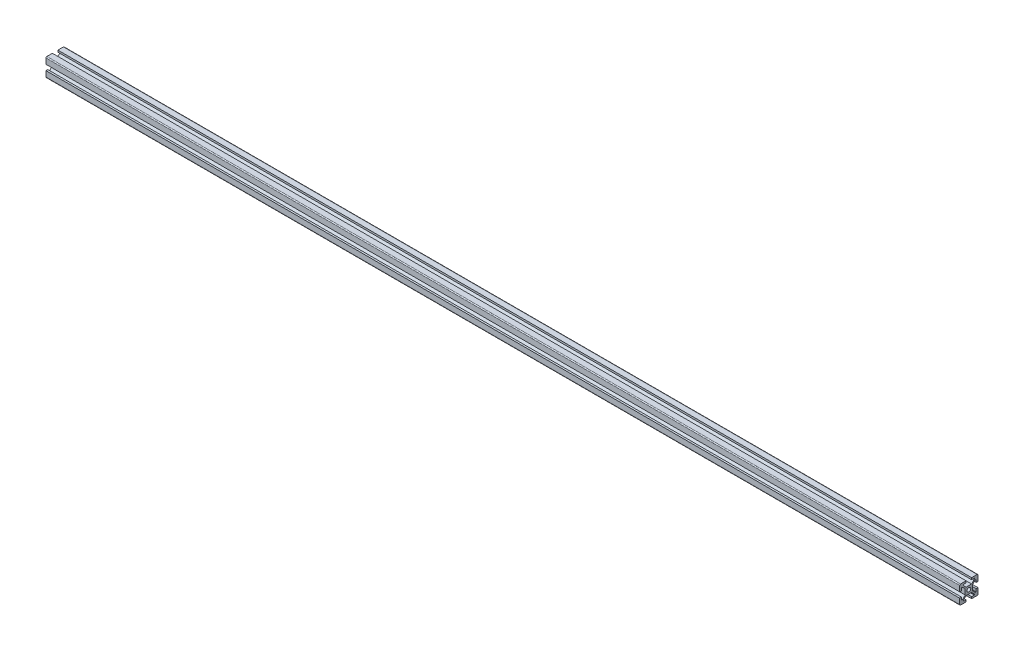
ISO-10303-21;
HEADER;
FILE_DESCRIPTION(('STEP AP214'),'2;1');
FILE_NAME('part.step','',(''),(''),'','','');
FILE_SCHEMA(('AUTOMOTIVE_DESIGN { 1 0 10303 214 1 1 1 1 }'));
ENDSEC;
DATA;
#1=APPLICATION_CONTEXT('core data for automotive mechanical design processes');
#2=APPLICATION_PROTOCOL_DEFINITION('international standard','automotive_design',2000,#1);
#3=PRODUCT_CONTEXT('',#1,'mechanical');
#4=PRODUCT('Part','Part','',(#3));
#5=PRODUCT_RELATED_PRODUCT_CATEGORY('part','',(#4));
#6=PRODUCT_DEFINITION_FORMATION('','',#4);
#7=PRODUCT_DEFINITION_CONTEXT('part definition',#1,'design');
#8=PRODUCT_DEFINITION('design','',#6,#7);
#9=PRODUCT_DEFINITION_SHAPE('','',#8);
#10=(LENGTH_UNIT() NAMED_UNIT(*) SI_UNIT(.MILLI.,.METRE.));
#11=(NAMED_UNIT(*) PLANE_ANGLE_UNIT() SI_UNIT($,.RADIAN.));
#12=(NAMED_UNIT(*) SI_UNIT($,.STERADIAN.) SOLID_ANGLE_UNIT());
#13=UNCERTAINTY_MEASURE_WITH_UNIT(LENGTH_MEASURE(1.E-05),#10,'distance_accuracy_value','');
#14=(GEOMETRIC_REPRESENTATION_CONTEXT(3) GLOBAL_UNCERTAINTY_ASSIGNED_CONTEXT((#13)) GLOBAL_UNIT_ASSIGNED_CONTEXT((#10,
#11,#12)) REPRESENTATION_CONTEXT('',''));
#15=CARTESIAN_POINT('',(0.,0.,0.));
#16=DIRECTION('',(0.,0.,1.));
#17=DIRECTION('',(1.,0.,0.));
#18=AXIS2_PLACEMENT_3D('',#15,#16,#17);
#19=CARTESIAN_POINT('',(1000.,9.,9.));
#20=DIRECTION('',(1.,0.,0.));
#21=DIRECTION('',(0.,0.,-1.));
#22=AXIS2_PLACEMENT_3D('',#19,#20,#21);
#23=PLANE('',#22);
#24=CARTESIAN_POINT('',(1000.,9.,9.));
#25=DIRECTION('',(1.,0.,0.));
#26=DIRECTION('',(0.,0.,-1.));
#27=AXIS2_PLACEMENT_3D('',#24,#25,#26);
#28=CIRCLE('',#27,1.);
#29=CARTESIAN_POINT('',(1000.,10.,9.));
#30=VERTEX_POINT('',#29);
#31=CARTESIAN_POINT('',(1000.,9.,10.));
#32=VERTEX_POINT('',#31);
#33=EDGE_CURVE('E467',#30,#32,#28,.T.);
#34=ORIENTED_EDGE('',*,*,#33,.T.);
#35=DIRECTION('',(0.,-1.,0.));
#36=VECTOR('',#35,1.);
#37=CARTESIAN_POINT('',(1000.,9.,10.));
#38=LINE('',#37,#36);
#39=CARTESIAN_POINT('',(1000.,3.,10.));
#40=VERTEX_POINT('',#39);
#41=EDGE_CURVE('E215',#32,#40,#38,.T.);
#42=ORIENTED_EDGE('',*,*,#41,.T.);
#43=DIRECTION('',(0.,0.,-1.));
#44=VECTOR('',#43,1.);
#45=CARTESIAN_POINT('',(1000.,3.,10.));
#46=LINE('',#45,#44);
#47=CARTESIAN_POINT('',(1000.,3.,8.));
#48=VERTEX_POINT('',#47);
#49=EDGE_CURVE('E602',#40,#48,#46,.T.);
#50=ORIENTED_EDGE('',*,*,#49,.T.);
#51=DIRECTION('',(0.,1.,0.));
#52=VECTOR('',#51,1.);
#53=CARTESIAN_POINT('',(1000.,3.,8.));
#54=LINE('',#53,#52);
#55=CARTESIAN_POINT('',(1000.,6.,8.));
#56=VERTEX_POINT('',#55);
#57=EDGE_CURVE('E621',#48,#56,#54,.T.);
#58=ORIENTED_EDGE('',*,*,#57,.T.);
#59=DIRECTION('',(0.,0.,-1.));
#60=VECTOR('',#59,1.);
#61=CARTESIAN_POINT('',(1000.,6.,8.));
#62=LINE('',#61,#60);
#63=CARTESIAN_POINT('',(1000.,6.,7.06066017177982));
#64=VERTEX_POINT('',#63);
#65=EDGE_CURVE('E618',#56,#64,#62,.T.);
#66=ORIENTED_EDGE('',*,*,#65,.T.);
#67=DIRECTION('',(0.,-0.707106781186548,-0.707106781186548));
#68=VECTOR('',#67,1.);
#69=CARTESIAN_POINT('',(1000.,6.,7.06066017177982));
#70=LINE('',#69,#68);
#71=CARTESIAN_POINT('',(1000.,2.93933982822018,4.));
#72=VERTEX_POINT('',#71);
#73=EDGE_CURVE('E620',#64,#72,#70,.T.);
#74=ORIENTED_EDGE('',*,*,#73,.T.);
#75=DIRECTION('',(0.,-1.,0.));
#76=VECTOR('',#75,1.);
#77=CARTESIAN_POINT('',(1000.,2.93933982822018,4.));
#78=LINE('',#77,#76);
#79=CARTESIAN_POINT('',(1000.,-2.93933982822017,4.));
#80=VERTEX_POINT('',#79);
#81=EDGE_CURVE('E623',#72,#80,#78,.T.);
#82=ORIENTED_EDGE('',*,*,#81,.T.);
#83=DIRECTION('',(0.,-0.707106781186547,0.707106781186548));
#84=VECTOR('',#83,1.);
#85=CARTESIAN_POINT('',(1000.,-2.93933982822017,4.));
#86=LINE('',#85,#84);
#87=CARTESIAN_POINT('',(1000.,-6.,7.06066017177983));
#88=VERTEX_POINT('',#87);
#89=EDGE_CURVE('E629',#80,#88,#86,.T.);
#90=ORIENTED_EDGE('',*,*,#89,.T.);
#91=DIRECTION('',(0.,0.,1.));
#92=VECTOR('',#91,1.);
#93=CARTESIAN_POINT('',(1000.,-6.,7.06066017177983));
#94=LINE('',#93,#92);
#95=CARTESIAN_POINT('',(1000.,-6.,7.99999999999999));
#96=VERTEX_POINT('',#95);
#97=EDGE_CURVE('E631',#88,#96,#94,.T.);
#98=ORIENTED_EDGE('',*,*,#97,.T.);
#99=DIRECTION('',(0.,1.,0.));
#100=VECTOR('',#99,1.);
#101=CARTESIAN_POINT('',(1000.,-6.,7.99999999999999));
#102=LINE('',#101,#100);
#103=CARTESIAN_POINT('',(1000.,-3.,7.99999999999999));
#104=VERTEX_POINT('',#103);
#105=EDGE_CURVE('E633',#96,#104,#102,.T.);
#106=ORIENTED_EDGE('',*,*,#105,.T.);
#107=DIRECTION('',(0.,0.,1.));
#108=VECTOR('',#107,1.);
#109=CARTESIAN_POINT('',(1000.,-3.,7.99999999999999));
#110=LINE('',#109,#108);
#111=CARTESIAN_POINT('',(1000.,-3.,10.));
#112=VERTEX_POINT('',#111);
#113=EDGE_CURVE('E635',#104,#112,#110,.T.);
#114=ORIENTED_EDGE('',*,*,#113,.T.);
#115=DIRECTION('',(0.,-1.,0.));
#116=VECTOR('',#115,1.);
#117=CARTESIAN_POINT('',(1000.,-3.,10.));
#118=LINE('',#117,#116);
#119=CARTESIAN_POINT('',(1000.,-9.,10.));
#120=VERTEX_POINT('',#119);
#121=EDGE_CURVE('E637',#112,#120,#118,.T.);
#122=ORIENTED_EDGE('',*,*,#121,.T.);
#123=CARTESIAN_POINT('',(1000.,-9.,9.));
#124=DIRECTION('',(1.,0.,0.));
#125=DIRECTION('',(0.,0.,-1.));
#126=AXIS2_PLACEMENT_3D('',#123,#124,#125);
#127=CIRCLE('',#126,1.);
#128=CARTESIAN_POINT('',(1000.,-10.,9.));
#129=VERTEX_POINT('',#128);
#130=EDGE_CURVE('E639',#120,#129,#127,.T.);
#131=ORIENTED_EDGE('',*,*,#130,.T.);
#132=DIRECTION('',(0.,0.,-1.));
#133=VECTOR('',#132,1.);
#134=CARTESIAN_POINT('',(1000.,-10.,9.));
#135=LINE('',#134,#133);
#136=CARTESIAN_POINT('',(1000.,-10.,3.));
#137=VERTEX_POINT('',#136);
#138=EDGE_CURVE('E641',#129,#137,#135,.T.);
#139=ORIENTED_EDGE('',*,*,#138,.T.);
#140=DIRECTION('',(0.,1.,0.));
#141=VECTOR('',#140,1.);
#142=CARTESIAN_POINT('',(1000.,-10.,3.));
#143=LINE('',#142,#141);
#144=CARTESIAN_POINT('',(1000.,-8.,3.));
#145=VERTEX_POINT('',#144);
#146=EDGE_CURVE('E643',#137,#145,#143,.T.);
#147=ORIENTED_EDGE('',*,*,#146,.T.);
#148=DIRECTION('',(0.,0.,1.));
#149=VECTOR('',#148,1.);
#150=CARTESIAN_POINT('',(1000.,-8.,3.));
#151=LINE('',#150,#149);
#152=CARTESIAN_POINT('',(1000.,-8.,6.));
#153=VERTEX_POINT('',#152);
#154=EDGE_CURVE('E645',#145,#153,#151,.T.);
#155=ORIENTED_EDGE('',*,*,#154,.T.);
#156=DIRECTION('',(0.,1.,0.));
#157=VECTOR('',#156,1.);
#158=CARTESIAN_POINT('',(1000.,-8.,6.));
#159=LINE('',#158,#157);
#160=CARTESIAN_POINT('',(1000.,-7.06066017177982,6.));
#161=VERTEX_POINT('',#160);
#162=EDGE_CURVE('E647',#153,#161,#159,.T.);
#163=ORIENTED_EDGE('',*,*,#162,.T.);
#164=DIRECTION('',(0.,0.707106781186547,-0.707106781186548));
#165=VECTOR('',#164,1.);
#166=CARTESIAN_POINT('',(1000.,-7.06066017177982,6.));
#167=LINE('',#166,#165);
#168=CARTESIAN_POINT('',(1000.,-4.,2.93933982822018));
#169=VERTEX_POINT('',#168);
#170=EDGE_CURVE('E649',#161,#169,#167,.T.);
#171=ORIENTED_EDGE('',*,*,#170,.T.);
#172=DIRECTION('',(0.,0.,-1.));
#173=VECTOR('',#172,1.);
#174=CARTESIAN_POINT('',(1000.,-4.,2.93933982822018));
#175=LINE('',#174,#173);
#176=CARTESIAN_POINT('',(1000.,-4.,-2.93933982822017));
#177=VERTEX_POINT('',#176);
#178=EDGE_CURVE('E651',#169,#177,#175,.T.);
#179=ORIENTED_EDGE('',*,*,#178,.T.);
#180=DIRECTION('',(0.,-0.707106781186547,-0.707106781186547));
#181=VECTOR('',#180,1.);
#182=CARTESIAN_POINT('',(1000.,-4.,-2.93933982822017));
#183=LINE('',#182,#181);
#184=CARTESIAN_POINT('',(1000.,-7.06066017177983,-6.));
#185=VERTEX_POINT('',#184);
#186=EDGE_CURVE('E653',#177,#185,#183,.T.);
#187=ORIENTED_EDGE('',*,*,#186,.T.);
#188=DIRECTION('',(0.,-1.,0.));
#189=VECTOR('',#188,1.);
#190=CARTESIAN_POINT('',(1000.,-7.06066017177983,-6.));
#191=LINE('',#190,#189);
#192=CARTESIAN_POINT('',(1000.,-7.99999999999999,-6.));
#193=VERTEX_POINT('',#192);
#194=EDGE_CURVE('E655',#185,#193,#191,.T.);
#195=ORIENTED_EDGE('',*,*,#194,.T.);
#196=DIRECTION('',(0.,0.,1.));
#197=VECTOR('',#196,1.);
#198=CARTESIAN_POINT('',(1000.,-7.99999999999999,-6.));
#199=LINE('',#198,#197);
#200=CARTESIAN_POINT('',(1000.,-7.99999999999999,-3.));
#201=VERTEX_POINT('',#200);
#202=EDGE_CURVE('E657',#193,#201,#199,.T.);
#203=ORIENTED_EDGE('',*,*,#202,.T.);
#204=DIRECTION('',(0.,-1.,0.));
#205=VECTOR('',#204,1.);
#206=CARTESIAN_POINT('',(1000.,-7.99999999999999,-3.));
#207=LINE('',#206,#205);
#208=CARTESIAN_POINT('',(1000.,-10.,-3.));
#209=VERTEX_POINT('',#208);
#210=EDGE_CURVE('E659',#201,#209,#207,.T.);
#211=ORIENTED_EDGE('',*,*,#210,.T.);
#212=DIRECTION('',(0.,0.,-1.));
#213=VECTOR('',#212,1.);
#214=CARTESIAN_POINT('',(1000.,-10.,-3.));
#215=LINE('',#214,#213);
#216=CARTESIAN_POINT('',(1000.,-10.,-9.00000000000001));
#217=VERTEX_POINT('',#216);
#218=EDGE_CURVE('E661',#209,#217,#215,.T.);
#219=ORIENTED_EDGE('',*,*,#218,.T.);
#220=CARTESIAN_POINT('',(1000.,-9.,-9.00000000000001));
#221=DIRECTION('',(1.,0.,0.));
#222=DIRECTION('',(0.,0.,-1.));
#223=AXIS2_PLACEMENT_3D('',#220,#221,#222);
#224=CIRCLE('',#223,0.999999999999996);
#225=CARTESIAN_POINT('',(1000.,-9.,-10.));
#226=VERTEX_POINT('',#225);
#227=EDGE_CURVE('E663',#217,#226,#224,.T.);
#228=ORIENTED_EDGE('',*,*,#227,.T.);
#229=DIRECTION('',(0.,1.,0.));
#230=VECTOR('',#229,1.);
#231=CARTESIAN_POINT('',(1000.,-9.,-10.));
#232=LINE('',#231,#230);
#233=CARTESIAN_POINT('',(1000.,-3.,-10.));
#234=VERTEX_POINT('',#233);
#235=EDGE_CURVE('E665',#226,#234,#232,.T.);
#236=ORIENTED_EDGE('',*,*,#235,.T.);
#237=DIRECTION('',(0.,0.,1.));
#238=VECTOR('',#237,1.);
#239=CARTESIAN_POINT('',(1000.,-3.,-10.));
#240=LINE('',#239,#238);
#241=CARTESIAN_POINT('',(1000.,-3.,-8.00000000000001));
#242=VERTEX_POINT('',#241);
#243=EDGE_CURVE('E667',#234,#242,#240,.T.);
#244=ORIENTED_EDGE('',*,*,#243,.T.);
#245=DIRECTION('',(0.,-1.,0.));
#246=VECTOR('',#245,1.);
#247=CARTESIAN_POINT('',(1000.,-3.,-8.00000000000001));
#248=LINE('',#247,#246);
#249=CARTESIAN_POINT('',(1000.,-6.,-8.00000000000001));
#250=VERTEX_POINT('',#249);
#251=EDGE_CURVE('E669',#242,#250,#248,.T.);
#252=ORIENTED_EDGE('',*,*,#251,.T.);
#253=DIRECTION('',(0.,0.,1.));
#254=VECTOR('',#253,1.);
#255=CARTESIAN_POINT('',(1000.,-6.,-8.00000000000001));
#256=LINE('',#255,#254);
#257=CARTESIAN_POINT('',(1000.,-6.,-7.06066017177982));
#258=VERTEX_POINT('',#257);
#259=EDGE_CURVE('E671',#250,#258,#256,.T.);
#260=ORIENTED_EDGE('',*,*,#259,.T.);
#261=DIRECTION('',(0.,0.707106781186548,0.707106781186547));
#262=VECTOR('',#261,1.);
#263=CARTESIAN_POINT('',(1000.,-6.,-7.06066017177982));
#264=LINE('',#263,#262);
#265=CARTESIAN_POINT('',(1000.,-2.93933982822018,-4.));
#266=VERTEX_POINT('',#265);
#267=EDGE_CURVE('E673',#258,#266,#264,.T.);
#268=ORIENTED_EDGE('',*,*,#267,.T.);
#269=DIRECTION('',(0.,1.,0.));
#270=VECTOR('',#269,1.);
#271=CARTESIAN_POINT('',(1000.,-2.93933982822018,-4.));
#272=LINE('',#271,#270);
#273=CARTESIAN_POINT('',(1000.,2.93933982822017,-4.));
#274=VERTEX_POINT('',#273);
#275=EDGE_CURVE('E675',#266,#274,#272,.T.);
#276=ORIENTED_EDGE('',*,*,#275,.T.);
#277=DIRECTION('',(0.,0.707106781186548,-0.707106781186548));
#278=VECTOR('',#277,1.);
#279=CARTESIAN_POINT('',(1000.,2.93933982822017,-4.));
#280=LINE('',#279,#278);
#281=CARTESIAN_POINT('',(1000.,6.,-7.06066017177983));
#282=VERTEX_POINT('',#281);
#283=EDGE_CURVE('E677',#274,#282,#280,.T.);
#284=ORIENTED_EDGE('',*,*,#283,.T.);
#285=DIRECTION('',(0.,0.,-1.));
#286=VECTOR('',#285,1.);
#287=CARTESIAN_POINT('',(1000.,6.,-7.06066017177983));
#288=LINE('',#287,#286);
#289=CARTESIAN_POINT('',(1000.,6.,-7.99999999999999));
#290=VERTEX_POINT('',#289);
#291=EDGE_CURVE('E679',#282,#290,#288,.T.);
#292=ORIENTED_EDGE('',*,*,#291,.T.);
#293=DIRECTION('',(0.,-1.,0.));
#294=VECTOR('',#293,1.);
#295=CARTESIAN_POINT('',(1000.,6.,-7.99999999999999));
#296=LINE('',#295,#294);
#297=CARTESIAN_POINT('',(1000.,3.,-7.99999999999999));
#298=VERTEX_POINT('',#297);
#299=EDGE_CURVE('E681',#290,#298,#296,.T.);
#300=ORIENTED_EDGE('',*,*,#299,.T.);
#301=DIRECTION('',(0.,0.,-1.));
#302=VECTOR('',#301,1.);
#303=CARTESIAN_POINT('',(1000.,3.,-7.99999999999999));
#304=LINE('',#303,#302);
#305=CARTESIAN_POINT('',(1000.,3.,-10.));
#306=VERTEX_POINT('',#305);
#307=EDGE_CURVE('E683',#298,#306,#304,.T.);
#308=ORIENTED_EDGE('',*,*,#307,.T.);
#309=DIRECTION('',(0.,1.,0.));
#310=VECTOR('',#309,1.);
#311=CARTESIAN_POINT('',(1000.,3.,-10.));
#312=LINE('',#311,#310);
#313=CARTESIAN_POINT('',(1000.,9.,-10.));
#314=VERTEX_POINT('',#313);
#315=EDGE_CURVE('E685',#306,#314,#312,.T.);
#316=ORIENTED_EDGE('',*,*,#315,.T.);
#317=CARTESIAN_POINT('',(1000.,9.,-9.00000000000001));
#318=DIRECTION('',(1.,0.,0.));
#319=DIRECTION('',(0.,0.,-1.));
#320=AXIS2_PLACEMENT_3D('',#317,#318,#319);
#321=CIRCLE('',#320,1.);
#322=CARTESIAN_POINT('',(1000.,10.,-9.00000000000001));
#323=VERTEX_POINT('',#322);
#324=EDGE_CURVE('E687',#314,#323,#321,.T.);
#325=ORIENTED_EDGE('',*,*,#324,.T.);
#326=DIRECTION('',(0.,0.,1.));
#327=VECTOR('',#326,1.);
#328=CARTESIAN_POINT('',(1000.,10.,-9.00000000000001));
#329=LINE('',#328,#327);
#330=CARTESIAN_POINT('',(1000.,10.,-3.));
#331=VERTEX_POINT('',#330);
#332=EDGE_CURVE('E689',#323,#331,#329,.T.);
#333=ORIENTED_EDGE('',*,*,#332,.T.);
#334=DIRECTION('',(0.,-1.,0.));
#335=VECTOR('',#334,1.);
#336=CARTESIAN_POINT('',(1000.,10.,-3.));
#337=LINE('',#336,#335);
#338=CARTESIAN_POINT('',(1000.,8.,-3.));
#339=VERTEX_POINT('',#338);
#340=EDGE_CURVE('E691',#331,#339,#337,.T.);
#341=ORIENTED_EDGE('',*,*,#340,.T.);
#342=DIRECTION('',(0.,0.,-1.));
#343=VECTOR('',#342,1.);
#344=CARTESIAN_POINT('',(1000.,8.,-3.));
#345=LINE('',#344,#343);
#346=CARTESIAN_POINT('',(1000.,8.,-6.));
#347=VERTEX_POINT('',#346);
#348=EDGE_CURVE('E693',#339,#347,#345,.T.);
#349=ORIENTED_EDGE('',*,*,#348,.T.);
#350=DIRECTION('',(0.,-1.,0.));
#351=VECTOR('',#350,1.);
#352=CARTESIAN_POINT('',(1000.,8.,-6.));
#353=LINE('',#352,#351);
#354=CARTESIAN_POINT('',(1000.,7.06066017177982,-6.));
#355=VERTEX_POINT('',#354);
#356=EDGE_CURVE('E695',#347,#355,#353,.T.);
#357=ORIENTED_EDGE('',*,*,#356,.T.);
#358=DIRECTION('',(0.,-0.707106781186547,0.707106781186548));
#359=VECTOR('',#358,1.);
#360=CARTESIAN_POINT('',(1000.,7.06066017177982,-6.));
#361=LINE('',#360,#359);
#362=CARTESIAN_POINT('',(1000.,4.,-2.93933982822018));
#363=VERTEX_POINT('',#362);
#364=EDGE_CURVE('E697',#355,#363,#361,.T.);
#365=ORIENTED_EDGE('',*,*,#364,.T.);
#366=DIRECTION('',(0.,0.,1.));
#367=VECTOR('',#366,1.);
#368=CARTESIAN_POINT('',(1000.,4.,-2.93933982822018));
#369=LINE('',#368,#367);
#370=CARTESIAN_POINT('',(1000.,4.,2.93933982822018));
#371=VERTEX_POINT('',#370);
#372=EDGE_CURVE('E699',#363,#371,#369,.T.);
#373=ORIENTED_EDGE('',*,*,#372,.T.);
#374=DIRECTION('',(0.,0.707106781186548,0.707106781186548));
#375=VECTOR('',#374,1.);
#376=CARTESIAN_POINT('',(1000.,4.,2.93933982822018));
#377=LINE('',#376,#375);
#378=CARTESIAN_POINT('',(1000.,7.06066017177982,6.));
#379=VERTEX_POINT('',#378);
#380=EDGE_CURVE('E701',#371,#379,#377,.T.);
#381=ORIENTED_EDGE('',*,*,#380,.T.);
#382=DIRECTION('',(0.,1.,0.));
#383=VECTOR('',#382,1.);
#384=CARTESIAN_POINT('',(1000.,7.06066017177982,6.));
#385=LINE('',#384,#383);
#386=CARTESIAN_POINT('',(1000.,7.99999999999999,6.));
#387=VERTEX_POINT('',#386);
#388=EDGE_CURVE('E354',#379,#387,#385,.T.);
#389=ORIENTED_EDGE('',*,*,#388,.T.);
#390=DIRECTION('',(0.,0.,-1.));
#391=VECTOR('',#390,1.);
#392=CARTESIAN_POINT('',(1000.,7.99999999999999,6.));
#393=LINE('',#392,#391);
#394=CARTESIAN_POINT('',(1000.,7.99999999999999,3.));
#395=VERTEX_POINT('',#394);
#396=EDGE_CURVE('E348',#387,#395,#393,.T.);
#397=ORIENTED_EDGE('',*,*,#396,.T.);
#398=DIRECTION('',(0.,1.,0.));
#399=VECTOR('',#398,1.);
#400=CARTESIAN_POINT('',(1000.,7.99999999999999,3.));
#401=LINE('',#400,#399);
#402=CARTESIAN_POINT('',(1000.,10.,3.));
#403=VERTEX_POINT('',#402);
#404=EDGE_CURVE('E352',#395,#403,#401,.T.);
#405=ORIENTED_EDGE('',*,*,#404,.T.);
#406=DIRECTION('',(0.,0.,1.));
#407=VECTOR('',#406,1.);
#408=CARTESIAN_POINT('',(1000.,10.,3.));
#409=LINE('',#408,#407);
#410=EDGE_CURVE('E52',#403,#30,#409,.T.);
#411=ORIENTED_EDGE('',*,*,#410,.T.);
#412=EDGE_LOOP('',(#34,#42,#50,#58,#66,#74,#82,#90,#98,#106,#114,#122,#131,#139,#147,#155,#163,
#171,#179,#187,#195,#203,#211,#219,#228,#236,#244,#252,#260,#268,#276,#284,#292,#300,#308,#316,
#325,#333,#341,#349,#357,#365,#373,#381,#389,#397,#405,#411));
#413=FACE_BOUND('',#412,.T.);
#414=CARTESIAN_POINT('',(1000.,0.,0.));
#415=DIRECTION('',(1.,0.,0.));
#416=DIRECTION('',(0.,0.,-1.));
#417=AXIS2_PLACEMENT_3D('',#414,#415,#416);
#418=CIRCLE('',#417,2.1);
#419=CARTESIAN_POINT('',(1000.,0.,-2.1));
#420=VERTEX_POINT('',#419);
#421=EDGE_CURVE('E376',#420,#420,#418,.T.);
#422=ORIENTED_EDGE('',*,*,#421,.F.);
#423=EDGE_LOOP('',(#422));
#424=FACE_BOUND('',#423,.T.);
#425=ADVANCED_FACE('F35',(#413,#424),#23,.T.);
#426=CARTESIAN_POINT('',(0.,9.,9.));
#427=DIRECTION('',(1.,0.,0.));
#428=DIRECTION('',(0.,0.,-1.));
#429=AXIS2_PLACEMENT_3D('',#426,#427,#428);
#430=PLANE('',#429);
#431=CARTESIAN_POINT('',(0.,9.,9.));
#432=DIRECTION('',(1.,0.,0.));
#433=DIRECTION('',(0.,0.,-1.));
#434=AXIS2_PLACEMENT_3D('',#431,#432,#433);
#435=CIRCLE('',#434,1.);
#436=CARTESIAN_POINT('',(0.,10.,9.));
#437=VERTEX_POINT('',#436);
#438=CARTESIAN_POINT('',(0.,9.,10.));
#439=VERTEX_POINT('',#438);
#440=EDGE_CURVE('E372',#437,#439,#435,.T.);
#441=ORIENTED_EDGE('',*,*,#440,.F.);
#442=DIRECTION('',(0.,0.,1.));
#443=VECTOR('',#442,1.);
#444=CARTESIAN_POINT('',(0.,10.,3.));
#445=LINE('',#444,#443);
#446=CARTESIAN_POINT('',(0.,10.,3.));
#447=VERTEX_POINT('',#446);
#448=EDGE_CURVE('E207',#447,#437,#445,.T.);
#449=ORIENTED_EDGE('',*,*,#448,.F.);
#450=DIRECTION('',(0.,1.,0.));
#451=VECTOR('',#450,1.);
#452=CARTESIAN_POINT('',(0.,7.99999999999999,3.));
#453=LINE('',#452,#451);
#454=CARTESIAN_POINT('',(0.,7.99999999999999,3.));
#455=VERTEX_POINT('',#454);
#456=EDGE_CURVE('E201',#455,#447,#453,.T.);
#457=ORIENTED_EDGE('',*,*,#456,.F.);
#458=DIRECTION('',(0.,0.,-1.));
#459=VECTOR('',#458,1.);
#460=CARTESIAN_POINT('',(0.,7.99999999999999,6.));
#461=LINE('',#460,#459);
#462=CARTESIAN_POINT('',(0.,7.99999999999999,6.));
#463=VERTEX_POINT('',#462);
#464=EDGE_CURVE('E362',#463,#455,#461,.T.);
#465=ORIENTED_EDGE('',*,*,#464,.F.);
#466=DIRECTION('',(0.,1.,0.));
#467=VECTOR('',#466,1.);
#468=CARTESIAN_POINT('',(0.,7.06066017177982,6.));
#469=LINE('',#468,#467);
#470=CARTESIAN_POINT('',(0.,7.06066017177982,6.));
#471=VERTEX_POINT('',#470);
#472=EDGE_CURVE('E462',#471,#463,#469,.T.);
#473=ORIENTED_EDGE('',*,*,#472,.F.);
#474=DIRECTION('',(0.,0.707106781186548,0.707106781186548));
#475=VECTOR('',#474,1.);
#476=CARTESIAN_POINT('',(0.,4.,2.93933982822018));
#477=LINE('',#476,#475);
#478=CARTESIAN_POINT('',(0.,4.,2.93933982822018));
#479=VERTEX_POINT('',#478);
#480=EDGE_CURVE('E460',#479,#471,#477,.T.);
#481=ORIENTED_EDGE('',*,*,#480,.F.);
#482=DIRECTION('',(0.,0.,1.));
#483=VECTOR('',#482,1.);
#484=CARTESIAN_POINT('',(0.,4.,-2.93933982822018));
#485=LINE('',#484,#483);
#486=CARTESIAN_POINT('',(0.,4.,-2.93933982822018));
#487=VERTEX_POINT('',#486);
#488=EDGE_CURVE('E458',#487,#479,#485,.T.);
#489=ORIENTED_EDGE('',*,*,#488,.F.);
#490=DIRECTION('',(0.,-0.707106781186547,0.707106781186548));
#491=VECTOR('',#490,1.);
#492=CARTESIAN_POINT('',(0.,7.06066017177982,-6.));
#493=LINE('',#492,#491);
#494=CARTESIAN_POINT('',(0.,7.06066017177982,-6.));
#495=VERTEX_POINT('',#494);
#496=EDGE_CURVE('E456',#495,#487,#493,.T.);
#497=ORIENTED_EDGE('',*,*,#496,.F.);
#498=DIRECTION('',(0.,-1.,0.));
#499=VECTOR('',#498,1.);
#500=CARTESIAN_POINT('',(0.,8.,-6.));
#501=LINE('',#500,#499);
#502=CARTESIAN_POINT('',(0.,8.,-6.));
#503=VERTEX_POINT('',#502);
#504=EDGE_CURVE('E454',#503,#495,#501,.T.);
#505=ORIENTED_EDGE('',*,*,#504,.F.);
#506=DIRECTION('',(0.,0.,-1.));
#507=VECTOR('',#506,1.);
#508=CARTESIAN_POINT('',(0.,8.,-3.));
#509=LINE('',#508,#507);
#510=CARTESIAN_POINT('',(0.,8.,-3.));
#511=VERTEX_POINT('',#510);
#512=EDGE_CURVE('E452',#511,#503,#509,.T.);
#513=ORIENTED_EDGE('',*,*,#512,.F.);
#514=DIRECTION('',(0.,-1.,0.));
#515=VECTOR('',#514,1.);
#516=CARTESIAN_POINT('',(0.,10.,-3.));
#517=LINE('',#516,#515);
#518=CARTESIAN_POINT('',(0.,10.,-3.));
#519=VERTEX_POINT('',#518);
#520=EDGE_CURVE('E450',#519,#511,#517,.T.);
#521=ORIENTED_EDGE('',*,*,#520,.F.);
#522=DIRECTION('',(0.,0.,1.));
#523=VECTOR('',#522,1.);
#524=CARTESIAN_POINT('',(0.,10.,-9.00000000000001));
#525=LINE('',#524,#523);
#526=CARTESIAN_POINT('',(0.,10.,-9.00000000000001));
#527=VERTEX_POINT('',#526);
#528=EDGE_CURVE('E448',#527,#519,#525,.T.);
#529=ORIENTED_EDGE('',*,*,#528,.F.);
#530=CARTESIAN_POINT('',(0.,9.,-9.00000000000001));
#531=DIRECTION('',(1.,0.,0.));
#532=DIRECTION('',(0.,0.,-1.));
#533=AXIS2_PLACEMENT_3D('',#530,#531,#532);
#534=CIRCLE('',#533,1.);
#535=CARTESIAN_POINT('',(0.,9.,-10.));
#536=VERTEX_POINT('',#535);
#537=EDGE_CURVE('E446',#536,#527,#534,.T.);
#538=ORIENTED_EDGE('',*,*,#537,.F.);
#539=DIRECTION('',(0.,1.,0.));
#540=VECTOR('',#539,1.);
#541=CARTESIAN_POINT('',(0.,3.,-10.));
#542=LINE('',#541,#540);
#543=CARTESIAN_POINT('',(0.,3.,-10.));
#544=VERTEX_POINT('',#543);
#545=EDGE_CURVE('E444',#544,#536,#542,.T.);
#546=ORIENTED_EDGE('',*,*,#545,.F.);
#547=DIRECTION('',(0.,0.,-1.));
#548=VECTOR('',#547,1.);
#549=CARTESIAN_POINT('',(0.,3.,-7.99999999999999));
#550=LINE('',#549,#548);
#551=CARTESIAN_POINT('',(0.,3.,-7.99999999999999));
#552=VERTEX_POINT('',#551);
#553=EDGE_CURVE('E442',#552,#544,#550,.T.);
#554=ORIENTED_EDGE('',*,*,#553,.F.);
#555=DIRECTION('',(0.,-1.,0.));
#556=VECTOR('',#555,1.);
#557=CARTESIAN_POINT('',(0.,6.,-7.99999999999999));
#558=LINE('',#557,#556);
#559=CARTESIAN_POINT('',(0.,6.,-7.99999999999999));
#560=VERTEX_POINT('',#559);
#561=EDGE_CURVE('E440',#560,#552,#558,.T.);
#562=ORIENTED_EDGE('',*,*,#561,.F.);
#563=DIRECTION('',(0.,0.,-1.));
#564=VECTOR('',#563,1.);
#565=CARTESIAN_POINT('',(0.,6.,-7.06066017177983));
#566=LINE('',#565,#564);
#567=CARTESIAN_POINT('',(0.,6.,-7.06066017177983));
#568=VERTEX_POINT('',#567);
#569=EDGE_CURVE('E438',#568,#560,#566,.T.);
#570=ORIENTED_EDGE('',*,*,#569,.F.);
#571=DIRECTION('',(0.,0.707106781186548,-0.707106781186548));
#572=VECTOR('',#571,1.);
#573=CARTESIAN_POINT('',(0.,2.93933982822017,-4.));
#574=LINE('',#573,#572);
#575=CARTESIAN_POINT('',(0.,2.93933982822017,-4.));
#576=VERTEX_POINT('',#575);
#577=EDGE_CURVE('E436',#576,#568,#574,.T.);
#578=ORIENTED_EDGE('',*,*,#577,.F.);
#579=DIRECTION('',(0.,1.,0.));
#580=VECTOR('',#579,1.);
#581=CARTESIAN_POINT('',(0.,-2.93933982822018,-4.));
#582=LINE('',#581,#580);
#583=CARTESIAN_POINT('',(0.,-2.93933982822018,-4.));
#584=VERTEX_POINT('',#583);
#585=EDGE_CURVE('E434',#584,#576,#582,.T.);
#586=ORIENTED_EDGE('',*,*,#585,.F.);
#587=DIRECTION('',(0.,0.707106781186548,0.707106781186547));
#588=VECTOR('',#587,1.);
#589=CARTESIAN_POINT('',(0.,-6.,-7.06066017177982));
#590=LINE('',#589,#588);
#591=CARTESIAN_POINT('',(0.,-6.,-7.06066017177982));
#592=VERTEX_POINT('',#591);
#593=EDGE_CURVE('E432',#592,#584,#590,.T.);
#594=ORIENTED_EDGE('',*,*,#593,.F.);
#595=DIRECTION('',(0.,0.,1.));
#596=VECTOR('',#595,1.);
#597=CARTESIAN_POINT('',(0.,-6.,-8.00000000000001));
#598=LINE('',#597,#596);
#599=CARTESIAN_POINT('',(0.,-6.,-8.00000000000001));
#600=VERTEX_POINT('',#599);
#601=EDGE_CURVE('E430',#600,#592,#598,.T.);
#602=ORIENTED_EDGE('',*,*,#601,.F.);
#603=DIRECTION('',(0.,-1.,0.));
#604=VECTOR('',#603,1.);
#605=CARTESIAN_POINT('',(0.,-3.,-8.00000000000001));
#606=LINE('',#605,#604);
#607=CARTESIAN_POINT('',(0.,-3.,-8.00000000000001));
#608=VERTEX_POINT('',#607);
#609=EDGE_CURVE('E428',#608,#600,#606,.T.);
#610=ORIENTED_EDGE('',*,*,#609,.F.);
#611=DIRECTION('',(0.,0.,1.));
#612=VECTOR('',#611,1.);
#613=CARTESIAN_POINT('',(0.,-3.,-10.));
#614=LINE('',#613,#612);
#615=CARTESIAN_POINT('',(0.,-3.,-10.));
#616=VERTEX_POINT('',#615);
#617=EDGE_CURVE('E426',#616,#608,#614,.T.);
#618=ORIENTED_EDGE('',*,*,#617,.F.);
#619=DIRECTION('',(0.,1.,0.));
#620=VECTOR('',#619,1.);
#621=CARTESIAN_POINT('',(0.,-9.,-10.));
#622=LINE('',#621,#620);
#623=CARTESIAN_POINT('',(0.,-9.,-10.));
#624=VERTEX_POINT('',#623);
#625=EDGE_CURVE('E424',#624,#616,#622,.T.);
#626=ORIENTED_EDGE('',*,*,#625,.F.);
#627=CARTESIAN_POINT('',(0.,-9.,-9.00000000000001));
#628=DIRECTION('',(1.,0.,0.));
#629=DIRECTION('',(0.,0.,-1.));
#630=AXIS2_PLACEMENT_3D('',#627,#628,#629);
#631=CIRCLE('',#630,0.999999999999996);
#632=CARTESIAN_POINT('',(0.,-10.,-9.00000000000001));
#633=VERTEX_POINT('',#632);
#634=EDGE_CURVE('E422',#633,#624,#631,.T.);
#635=ORIENTED_EDGE('',*,*,#634,.F.);
#636=DIRECTION('',(0.,0.,-1.));
#637=VECTOR('',#636,1.);
#638=CARTESIAN_POINT('',(0.,-10.,-3.));
#639=LINE('',#638,#637);
#640=CARTESIAN_POINT('',(0.,-10.,-3.));
#641=VERTEX_POINT('',#640);
#642=EDGE_CURVE('E420',#641,#633,#639,.T.);
#643=ORIENTED_EDGE('',*,*,#642,.F.);
#644=DIRECTION('',(0.,-1.,0.));
#645=VECTOR('',#644,1.);
#646=CARTESIAN_POINT('',(0.,-7.99999999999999,-3.));
#647=LINE('',#646,#645);
#648=CARTESIAN_POINT('',(0.,-7.99999999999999,-3.));
#649=VERTEX_POINT('',#648);
#650=EDGE_CURVE('E418',#649,#641,#647,.T.);
#651=ORIENTED_EDGE('',*,*,#650,.F.);
#652=DIRECTION('',(0.,0.,1.));
#653=VECTOR('',#652,1.);
#654=CARTESIAN_POINT('',(0.,-7.99999999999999,-6.));
#655=LINE('',#654,#653);
#656=CARTESIAN_POINT('',(0.,-7.99999999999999,-6.));
#657=VERTEX_POINT('',#656);
#658=EDGE_CURVE('E416',#657,#649,#655,.T.);
#659=ORIENTED_EDGE('',*,*,#658,.F.);
#660=DIRECTION('',(0.,-1.,0.));
#661=VECTOR('',#660,1.);
#662=CARTESIAN_POINT('',(0.,-7.06066017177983,-6.));
#663=LINE('',#662,#661);
#664=CARTESIAN_POINT('',(0.,-7.06066017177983,-6.));
#665=VERTEX_POINT('',#664);
#666=EDGE_CURVE('E414',#665,#657,#663,.T.);
#667=ORIENTED_EDGE('',*,*,#666,.F.);
#668=DIRECTION('',(0.,-0.707106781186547,-0.707106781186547));
#669=VECTOR('',#668,1.);
#670=CARTESIAN_POINT('',(0.,-4.,-2.93933982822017));
#671=LINE('',#670,#669);
#672=CARTESIAN_POINT('',(0.,-4.,-2.93933982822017));
#673=VERTEX_POINT('',#672);
#674=EDGE_CURVE('E412',#673,#665,#671,.T.);
#675=ORIENTED_EDGE('',*,*,#674,.F.);
#676=DIRECTION('',(0.,0.,-1.));
#677=VECTOR('',#676,1.);
#678=CARTESIAN_POINT('',(0.,-4.,2.93933982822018));
#679=LINE('',#678,#677);
#680=CARTESIAN_POINT('',(0.,-4.,2.93933982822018));
#681=VERTEX_POINT('',#680);
#682=EDGE_CURVE('E410',#681,#673,#679,.T.);
#683=ORIENTED_EDGE('',*,*,#682,.F.);
#684=DIRECTION('',(0.,0.707106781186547,-0.707106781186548));
#685=VECTOR('',#684,1.);
#686=CARTESIAN_POINT('',(0.,-7.06066017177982,6.));
#687=LINE('',#686,#685);
#688=CARTESIAN_POINT('',(0.,-7.06066017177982,6.));
#689=VERTEX_POINT('',#688);
#690=EDGE_CURVE('E408',#689,#681,#687,.T.);
#691=ORIENTED_EDGE('',*,*,#690,.F.);
#692=DIRECTION('',(0.,1.,0.));
#693=VECTOR('',#692,1.);
#694=CARTESIAN_POINT('',(0.,-8.,6.));
#695=LINE('',#694,#693);
#696=CARTESIAN_POINT('',(0.,-8.,6.));
#697=VERTEX_POINT('',#696);
#698=EDGE_CURVE('E406',#697,#689,#695,.T.);
#699=ORIENTED_EDGE('',*,*,#698,.F.);
#700=DIRECTION('',(0.,0.,1.));
#701=VECTOR('',#700,1.);
#702=CARTESIAN_POINT('',(0.,-8.,3.));
#703=LINE('',#702,#701);
#704=CARTESIAN_POINT('',(0.,-8.,3.));
#705=VERTEX_POINT('',#704);
#706=EDGE_CURVE('E404',#705,#697,#703,.T.);
#707=ORIENTED_EDGE('',*,*,#706,.F.);
#708=DIRECTION('',(0.,1.,0.));
#709=VECTOR('',#708,1.);
#710=CARTESIAN_POINT('',(0.,-10.,3.));
#711=LINE('',#710,#709);
#712=CARTESIAN_POINT('',(0.,-10.,3.));
#713=VERTEX_POINT('',#712);
#714=EDGE_CURVE('E402',#713,#705,#711,.T.);
#715=ORIENTED_EDGE('',*,*,#714,.F.);
#716=DIRECTION('',(0.,0.,-1.));
#717=VECTOR('',#716,1.);
#718=CARTESIAN_POINT('',(0.,-10.,9.));
#719=LINE('',#718,#717);
#720=CARTESIAN_POINT('',(0.,-10.,9.));
#721=VERTEX_POINT('',#720);
#722=EDGE_CURVE('E400',#721,#713,#719,.T.);
#723=ORIENTED_EDGE('',*,*,#722,.F.);
#724=CARTESIAN_POINT('',(0.,-9.,9.));
#725=DIRECTION('',(1.,0.,0.));
#726=DIRECTION('',(0.,0.,-1.));
#727=AXIS2_PLACEMENT_3D('',#724,#725,#726);
#728=CIRCLE('',#727,1.);
#729=CARTESIAN_POINT('',(0.,-9.,10.));
#730=VERTEX_POINT('',#729);
#731=EDGE_CURVE('E398',#730,#721,#728,.T.);
#732=ORIENTED_EDGE('',*,*,#731,.F.);
#733=DIRECTION('',(0.,-1.,0.));
#734=VECTOR('',#733,1.);
#735=CARTESIAN_POINT('',(0.,-3.,10.));
#736=LINE('',#735,#734);
#737=CARTESIAN_POINT('',(0.,-3.,10.));
#738=VERTEX_POINT('',#737);
#739=EDGE_CURVE('E396',#738,#730,#736,.T.);
#740=ORIENTED_EDGE('',*,*,#739,.F.);
#741=DIRECTION('',(0.,0.,1.));
#742=VECTOR('',#741,1.);
#743=CARTESIAN_POINT('',(0.,-3.,7.99999999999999));
#744=LINE('',#743,#742);
#745=CARTESIAN_POINT('',(0.,-3.,7.99999999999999));
#746=VERTEX_POINT('',#745);
#747=EDGE_CURVE('E394',#746,#738,#744,.T.);
#748=ORIENTED_EDGE('',*,*,#747,.F.);
#749=DIRECTION('',(0.,1.,0.));
#750=VECTOR('',#749,1.);
#751=CARTESIAN_POINT('',(0.,-6.,7.99999999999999));
#752=LINE('',#751,#750);
#753=CARTESIAN_POINT('',(0.,-6.,7.99999999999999));
#754=VERTEX_POINT('',#753);
#755=EDGE_CURVE('E392',#754,#746,#752,.T.);
#756=ORIENTED_EDGE('',*,*,#755,.F.);
#757=DIRECTION('',(0.,0.,1.));
#758=VECTOR('',#757,1.);
#759=CARTESIAN_POINT('',(0.,-6.,7.06066017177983));
#760=LINE('',#759,#758);
#761=CARTESIAN_POINT('',(0.,-6.,7.06066017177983));
#762=VERTEX_POINT('',#761);
#763=EDGE_CURVE('E390',#762,#754,#760,.T.);
#764=ORIENTED_EDGE('',*,*,#763,.F.);
#765=DIRECTION('',(0.,-0.707106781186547,0.707106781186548));
#766=VECTOR('',#765,1.);
#767=CARTESIAN_POINT('',(0.,-2.93933982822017,4.));
#768=LINE('',#767,#766);
#769=CARTESIAN_POINT('',(0.,-2.93933982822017,4.));
#770=VERTEX_POINT('',#769);
#771=EDGE_CURVE('E388',#770,#762,#768,.T.);
#772=ORIENTED_EDGE('',*,*,#771,.F.);
#773=DIRECTION('',(0.,-1.,0.));
#774=VECTOR('',#773,1.);
#775=CARTESIAN_POINT('',(0.,2.93933982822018,4.));
#776=LINE('',#775,#774);
#777=CARTESIAN_POINT('',(0.,2.93933982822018,4.));
#778=VERTEX_POINT('',#777);
#779=EDGE_CURVE('E386',#778,#770,#776,.T.);
#780=ORIENTED_EDGE('',*,*,#779,.F.);
#781=DIRECTION('',(0.,-0.707106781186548,-0.707106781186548));
#782=VECTOR('',#781,1.);
#783=CARTESIAN_POINT('',(0.,6.,7.06066017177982));
#784=LINE('',#783,#782);
#785=CARTESIAN_POINT('',(0.,6.,7.06066017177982));
#786=VERTEX_POINT('',#785);
#787=EDGE_CURVE('E384',#786,#778,#784,.T.);
#788=ORIENTED_EDGE('',*,*,#787,.F.);
#789=DIRECTION('',(0.,0.,-1.));
#790=VECTOR('',#789,1.);
#791=CARTESIAN_POINT('',(0.,6.,8.));
#792=LINE('',#791,#790);
#793=CARTESIAN_POINT('',(0.,6.,8.));
#794=VERTEX_POINT('',#793);
#795=EDGE_CURVE('E382',#794,#786,#792,.T.);
#796=ORIENTED_EDGE('',*,*,#795,.F.);
#797=DIRECTION('',(0.,1.,0.));
#798=VECTOR('',#797,1.);
#799=CARTESIAN_POINT('',(0.,3.,8.));
#800=LINE('',#799,#798);
#801=CARTESIAN_POINT('',(0.,3.,8.));
#802=VERTEX_POINT('',#801);
#803=EDGE_CURVE('E380',#802,#794,#800,.T.);
#804=ORIENTED_EDGE('',*,*,#803,.F.);
#805=DIRECTION('',(0.,0.,-1.));
#806=VECTOR('',#805,1.);
#807=CARTESIAN_POINT('',(0.,3.,10.));
#808=LINE('',#807,#806);
#809=CARTESIAN_POINT('',(0.,3.,10.));
#810=VERTEX_POINT('',#809);
#811=EDGE_CURVE('E378',#810,#802,#808,.T.);
#812=ORIENTED_EDGE('',*,*,#811,.F.);
#813=DIRECTION('',(0.,-1.,0.));
#814=VECTOR('',#813,1.);
#815=CARTESIAN_POINT('',(0.,9.,10.));
#816=LINE('',#815,#814);
#817=EDGE_CURVE('E375',#439,#810,#816,.T.);
#818=ORIENTED_EDGE('',*,*,#817,.F.);
#819=EDGE_LOOP('',(#441,#449,#457,#465,#473,#481,#489,#497,#505,#513,#521,#529,#538,#546,#554,
#562,#570,#578,#586,#594,#602,#610,#618,#626,#635,#643,#651,#659,#667,#675,#683,#691,#699,#707,
#715,#723,#732,#740,#748,#756,#764,#772,#780,#788,#796,#804,#812,#818));
#820=FACE_BOUND('',#819,.T.);
#821=CARTESIAN_POINT('',(0.,0.,0.));
#822=DIRECTION('',(1.,0.,0.));
#823=DIRECTION('',(0.,0.,-1.));
#824=AXIS2_PLACEMENT_3D('',#821,#822,#823);
#825=CIRCLE('',#824,2.1);
#826=CARTESIAN_POINT('',(0.,0.,-2.1));
#827=VERTEX_POINT('',#826);
#828=EDGE_CURVE('E1328',#827,#827,#825,.T.);
#829=ORIENTED_EDGE('',*,*,#828,.T.);
#830=EDGE_LOOP('',(#829));
#831=FACE_BOUND('',#830,.T.);
#832=ADVANCED_FACE('F606',(#820,#831),#430,.F.);
#833=CARTESIAN_POINT('',(1000.,9.,9.));
#834=DIRECTION('',(-1.,0.,0.));
#835=DIRECTION('',(0.,0.,1.));
#836=AXIS2_PLACEMENT_3D('',#833,#834,#835);
#837=CYLINDRICAL_SURFACE('',#836,1.);
#838=ORIENTED_EDGE('',*,*,#440,.T.);
#839=DIRECTION('',(-1.,0.,0.));
#840=VECTOR('',#839,1.);
#841=CARTESIAN_POINT('',(1000.,9.,10.));
#842=LINE('',#841,#840);
#843=EDGE_CURVE('E11',#32,#439,#842,.T.);
#844=ORIENTED_EDGE('',*,*,#843,.F.);
#845=ORIENTED_EDGE('',*,*,#33,.F.);
#846=DIRECTION('',(-1.,0.,0.));
#847=VECTOR('',#846,1.);
#848=CARTESIAN_POINT('',(1000.,10.,9.));
#849=LINE('',#848,#847);
#850=EDGE_CURVE('E368',#30,#437,#849,.T.);
#851=ORIENTED_EDGE('',*,*,#850,.T.);
#852=EDGE_LOOP('',(#838,#844,#845,#851));
#853=FACE_BOUND('',#852,.T.);
#854=ADVANCED_FACE('F37',(#853),#837,.T.);
#855=CARTESIAN_POINT('',(1000.,9.,10.));
#856=DIRECTION('',(0.,0.,-1.));
#857=DIRECTION('',(-1.,0.,0.));
#858=AXIS2_PLACEMENT_3D('',#855,#856,#857);
#859=PLANE('',#858);
#860=ORIENTED_EDGE('',*,*,#817,.T.);
#861=DIRECTION('',(-1.,0.,0.));
#862=VECTOR('',#861,1.);
#863=CARTESIAN_POINT('',(1000.,3.,10.));
#864=LINE('',#863,#862);
#865=EDGE_CURVE('E44',#40,#810,#864,.T.);
#866=ORIENTED_EDGE('',*,*,#865,.F.);
#867=ORIENTED_EDGE('',*,*,#41,.F.);
#868=ORIENTED_EDGE('',*,*,#843,.T.);
#869=EDGE_LOOP('',(#860,#866,#867,#868));
#870=FACE_BOUND('',#869,.T.);
#871=ADVANCED_FACE('F735',(#870),#859,.F.);
#872=CARTESIAN_POINT('',(1000.,3.,10.));
#873=DIRECTION('',(0.,1.,0.));
#874=DIRECTION('',(0.,0.,1.));
#875=AXIS2_PLACEMENT_3D('',#872,#873,#874);
#876=PLANE('',#875);
#877=ORIENTED_EDGE('',*,*,#811,.T.);
#878=DIRECTION('',(-1.,0.,0.));
#879=VECTOR('',#878,1.);
#880=CARTESIAN_POINT('',(1000.,3.,8.));
#881=LINE('',#880,#879);
#882=EDGE_CURVE('E594',#48,#802,#881,.T.);
#883=ORIENTED_EDGE('',*,*,#882,.F.);
#884=ORIENTED_EDGE('',*,*,#49,.F.);
#885=ORIENTED_EDGE('',*,*,#865,.T.);
#886=EDGE_LOOP('',(#877,#883,#884,#885));
#887=FACE_BOUND('',#886,.T.);
#888=ADVANCED_FACE('F600',(#887),#876,.F.);
#889=CARTESIAN_POINT('',(1000.,3.,8.));
#890=DIRECTION('',(0.,0.,1.));
#891=DIRECTION('',(1.,0.,0.));
#892=AXIS2_PLACEMENT_3D('',#889,#890,#891);
#893=PLANE('',#892);
#894=ORIENTED_EDGE('',*,*,#803,.T.);
#895=DIRECTION('',(-1.,0.,0.));
#896=VECTOR('',#895,1.);
#897=CARTESIAN_POINT('',(1000.,6.,8.));
#898=LINE('',#897,#896);
#899=EDGE_CURVE('E591',#56,#794,#898,.T.);
#900=ORIENTED_EDGE('',*,*,#899,.F.);
#901=ORIENTED_EDGE('',*,*,#57,.F.);
#902=ORIENTED_EDGE('',*,*,#882,.T.);
#903=EDGE_LOOP('',(#894,#900,#901,#902));
#904=FACE_BOUND('',#903,.T.);
#905=ADVANCED_FACE('F612',(#904),#893,.F.);
#906=CARTESIAN_POINT('',(1000.,6.,8.));
#907=DIRECTION('',(0.,1.,0.));
#908=DIRECTION('',(0.,0.,1.));
#909=AXIS2_PLACEMENT_3D('',#906,#907,#908);
#910=PLANE('',#909);
#911=ORIENTED_EDGE('',*,*,#795,.T.);
#912=DIRECTION('',(-1.,0.,0.));
#913=VECTOR('',#912,1.);
#914=CARTESIAN_POINT('',(1000.,6.,7.06066017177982));
#915=LINE('',#914,#913);
#916=EDGE_CURVE('E588',#64,#786,#915,.T.);
#917=ORIENTED_EDGE('',*,*,#916,.F.);
#918=ORIENTED_EDGE('',*,*,#65,.F.);
#919=ORIENTED_EDGE('',*,*,#899,.T.);
#920=EDGE_LOOP('',(#911,#917,#918,#919));
#921=FACE_BOUND('',#920,.T.);
#922=ADVANCED_FACE('F616',(#921),#910,.F.);
#923=CARTESIAN_POINT('',(1000.,6.,7.06066017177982));
#924=DIRECTION('',(0.,0.707106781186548,-0.707106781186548));
#925=DIRECTION('',(0.,0.707106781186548,0.707106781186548));
#926=AXIS2_PLACEMENT_3D('',#923,#924,#925);
#927=PLANE('',#926);
#928=ORIENTED_EDGE('',*,*,#787,.T.);
#929=DIRECTION('',(-1.,0.,0.));
#930=VECTOR('',#929,1.);
#931=CARTESIAN_POINT('',(1000.,2.93933982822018,4.));
#932=LINE('',#931,#930);
#933=EDGE_CURVE('E585',#72,#778,#932,.T.);
#934=ORIENTED_EDGE('',*,*,#933,.F.);
#935=ORIENTED_EDGE('',*,*,#73,.F.);
#936=ORIENTED_EDGE('',*,*,#916,.T.);
#937=EDGE_LOOP('',(#928,#934,#935,#936));
#938=FACE_BOUND('',#937,.T.);
#939=ADVANCED_FACE('F748',(#938),#927,.F.);
#940=CARTESIAN_POINT('',(1000.,2.93933982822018,4.));
#941=DIRECTION('',(0.,0.,-1.));
#942=DIRECTION('',(-1.,0.,0.));
#943=AXIS2_PLACEMENT_3D('',#940,#941,#942);
#944=PLANE('',#943);
#945=ORIENTED_EDGE('',*,*,#779,.T.);
#946=DIRECTION('',(-1.,0.,0.));
#947=VECTOR('',#946,1.);
#948=CARTESIAN_POINT('',(1000.,-2.93933982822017,4.));
#949=LINE('',#948,#947);
#950=EDGE_CURVE('E582',#80,#770,#949,.T.);
#951=ORIENTED_EDGE('',*,*,#950,.F.);
#952=ORIENTED_EDGE('',*,*,#81,.F.);
#953=ORIENTED_EDGE('',*,*,#933,.T.);
#954=EDGE_LOOP('',(#945,#951,#952,#953));
#955=FACE_BOUND('',#954,.T.);
#956=ADVANCED_FACE('F751',(#955),#944,.F.);
#957=CARTESIAN_POINT('',(1000.,-2.93933982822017,4.));
#958=DIRECTION('',(0.,-0.707106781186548,-0.707106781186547));
#959=DIRECTION('',(0.,0.707106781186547,-0.707106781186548));
#960=AXIS2_PLACEMENT_3D('',#957,#958,#959);
#961=PLANE('',#960);
#962=ORIENTED_EDGE('',*,*,#771,.T.);
#963=DIRECTION('',(-1.,0.,0.));
#964=VECTOR('',#963,1.);
#965=CARTESIAN_POINT('',(1000.,-6.,7.06066017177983));
#966=LINE('',#965,#964);
#967=EDGE_CURVE('E579',#88,#762,#966,.T.);
#968=ORIENTED_EDGE('',*,*,#967,.F.);
#969=ORIENTED_EDGE('',*,*,#89,.F.);
#970=ORIENTED_EDGE('',*,*,#950,.T.);
#971=EDGE_LOOP('',(#962,#968,#969,#970));
#972=FACE_BOUND('',#971,.T.);
#973=ADVANCED_FACE('F755',(#972),#961,.F.);
#974=CARTESIAN_POINT('',(1000.,-6.,7.06066017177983));
#975=DIRECTION('',(0.,-1.,0.));
#976=DIRECTION('',(0.,0.,-1.));
#977=AXIS2_PLACEMENT_3D('',#974,#975,#976);
#978=PLANE('',#977);
#979=ORIENTED_EDGE('',*,*,#763,.T.);
#980=DIRECTION('',(-1.,0.,0.));
#981=VECTOR('',#980,1.);
#982=CARTESIAN_POINT('',(1000.,-6.,7.99999999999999));
#983=LINE('',#982,#981);
#984=EDGE_CURVE('E576',#96,#754,#983,.T.);
#985=ORIENTED_EDGE('',*,*,#984,.F.);
#986=ORIENTED_EDGE('',*,*,#97,.F.);
#987=ORIENTED_EDGE('',*,*,#967,.T.);
#988=EDGE_LOOP('',(#979,#985,#986,#987));
#989=FACE_BOUND('',#988,.T.);
#990=ADVANCED_FACE('F759',(#989),#978,.F.);
#991=CARTESIAN_POINT('',(1000.,-6.,7.99999999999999));
#992=DIRECTION('',(0.,0.,1.));
#993=DIRECTION('',(1.,0.,0.));
#994=AXIS2_PLACEMENT_3D('',#991,#992,#993);
#995=PLANE('',#994);
#996=ORIENTED_EDGE('',*,*,#755,.T.);
#997=DIRECTION('',(-1.,0.,0.));
#998=VECTOR('',#997,1.);
#999=CARTESIAN_POINT('',(1000.,-3.,7.99999999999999));
#1000=LINE('',#999,#998);
#1001=EDGE_CURVE('E573',#104,#746,#1000,.T.);
#1002=ORIENTED_EDGE('',*,*,#1001,.F.);
#1003=ORIENTED_EDGE('',*,*,#105,.F.);
#1004=ORIENTED_EDGE('',*,*,#984,.T.);
#1005=EDGE_LOOP('',(#996,#1002,#1003,#1004));
#1006=FACE_BOUND('',#1005,.T.);
#1007=ADVANCED_FACE('F763',(#1006),#995,.F.);
#1008=CARTESIAN_POINT('',(1000.,-3.,7.99999999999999));
#1009=DIRECTION('',(0.,-1.,0.));
#1010=DIRECTION('',(0.,0.,-1.));
#1011=AXIS2_PLACEMENT_3D('',#1008,#1009,#1010);
#1012=PLANE('',#1011);
#1013=ORIENTED_EDGE('',*,*,#747,.T.);
#1014=DIRECTION('',(-1.,0.,0.));
#1015=VECTOR('',#1014,1.);
#1016=CARTESIAN_POINT('',(1000.,-3.,10.));
#1017=LINE('',#1016,#1015);
#1018=EDGE_CURVE('E570',#112,#738,#1017,.T.);
#1019=ORIENTED_EDGE('',*,*,#1018,.F.);
#1020=ORIENTED_EDGE('',*,*,#113,.F.);
#1021=ORIENTED_EDGE('',*,*,#1001,.T.);
#1022=EDGE_LOOP('',(#1013,#1019,#1020,#1021));
#1023=FACE_BOUND('',#1022,.T.);
#1024=ADVANCED_FACE('F767',(#1023),#1012,.F.);
#1025=CARTESIAN_POINT('',(1000.,-3.,10.));
#1026=DIRECTION('',(0.,0.,-1.));
#1027=DIRECTION('',(-1.,0.,0.));
#1028=AXIS2_PLACEMENT_3D('',#1025,#1026,#1027);
#1029=PLANE('',#1028);
#1030=ORIENTED_EDGE('',*,*,#739,.T.);
#1031=DIRECTION('',(-1.,0.,0.));
#1032=VECTOR('',#1031,1.);
#1033=CARTESIAN_POINT('',(1000.,-9.,10.));
#1034=LINE('',#1033,#1032);
#1035=EDGE_CURVE('E567',#120,#730,#1034,.T.);
#1036=ORIENTED_EDGE('',*,*,#1035,.F.);
#1037=ORIENTED_EDGE('',*,*,#121,.F.);
#1038=ORIENTED_EDGE('',*,*,#1018,.T.);
#1039=EDGE_LOOP('',(#1030,#1036,#1037,#1038));
#1040=FACE_BOUND('',#1039,.T.);
#1041=ADVANCED_FACE('F771',(#1040),#1029,.F.);
#1042=CARTESIAN_POINT('',(1000.,-9.,9.));
#1043=DIRECTION('',(-1.,0.,0.));
#1044=DIRECTION('',(0.,0.,1.));
#1045=AXIS2_PLACEMENT_3D('',#1042,#1043,#1044);
#1046=CYLINDRICAL_SURFACE('',#1045,1.);
#1047=ORIENTED_EDGE('',*,*,#731,.T.);
#1048=DIRECTION('',(-1.,0.,0.));
#1049=VECTOR('',#1048,1.);
#1050=CARTESIAN_POINT('',(1000.,-10.,9.));
#1051=LINE('',#1050,#1049);
#1052=EDGE_CURVE('E564',#129,#721,#1051,.T.);
#1053=ORIENTED_EDGE('',*,*,#1052,.F.);
#1054=ORIENTED_EDGE('',*,*,#130,.F.);
#1055=ORIENTED_EDGE('',*,*,#1035,.T.);
#1056=EDGE_LOOP('',(#1047,#1053,#1054,#1055));
#1057=FACE_BOUND('',#1056,.T.);
#1058=ADVANCED_FACE('F775',(#1057),#1046,.T.);
#1059=CARTESIAN_POINT('',(1000.,-10.,9.));
#1060=DIRECTION('',(0.,1.,0.));
#1061=DIRECTION('',(0.,0.,1.));
#1062=AXIS2_PLACEMENT_3D('',#1059,#1060,#1061);
#1063=PLANE('',#1062);
#1064=ORIENTED_EDGE('',*,*,#722,.T.);
#1065=DIRECTION('',(-1.,0.,0.));
#1066=VECTOR('',#1065,1.);
#1067=CARTESIAN_POINT('',(1000.,-10.,3.));
#1068=LINE('',#1067,#1066);
#1069=EDGE_CURVE('E561',#137,#713,#1068,.T.);
#1070=ORIENTED_EDGE('',*,*,#1069,.F.);
#1071=ORIENTED_EDGE('',*,*,#138,.F.);
#1072=ORIENTED_EDGE('',*,*,#1052,.T.);
#1073=EDGE_LOOP('',(#1064,#1070,#1071,#1072));
#1074=FACE_BOUND('',#1073,.T.);
#1075=ADVANCED_FACE('F779',(#1074),#1063,.F.);
#1076=CARTESIAN_POINT('',(1000.,-10.,3.));
#1077=DIRECTION('',(0.,0.,1.));
#1078=DIRECTION('',(1.,0.,0.));
#1079=AXIS2_PLACEMENT_3D('',#1076,#1077,#1078);
#1080=PLANE('',#1079);
#1081=ORIENTED_EDGE('',*,*,#714,.T.);
#1082=DIRECTION('',(-1.,0.,0.));
#1083=VECTOR('',#1082,1.);
#1084=CARTESIAN_POINT('',(1000.,-8.,3.));
#1085=LINE('',#1084,#1083);
#1086=EDGE_CURVE('E558',#145,#705,#1085,.T.);
#1087=ORIENTED_EDGE('',*,*,#1086,.F.);
#1088=ORIENTED_EDGE('',*,*,#146,.F.);
#1089=ORIENTED_EDGE('',*,*,#1069,.T.);
#1090=EDGE_LOOP('',(#1081,#1087,#1088,#1089));
#1091=FACE_BOUND('',#1090,.T.);
#1092=ADVANCED_FACE('F783',(#1091),#1080,.F.);
#1093=CARTESIAN_POINT('',(1000.,-8.,3.));
#1094=DIRECTION('',(0.,-1.,0.));
#1095=DIRECTION('',(0.,0.,-1.));
#1096=AXIS2_PLACEMENT_3D('',#1093,#1094,#1095);
#1097=PLANE('',#1096);
#1098=ORIENTED_EDGE('',*,*,#706,.T.);
#1099=DIRECTION('',(-1.,0.,0.));
#1100=VECTOR('',#1099,1.);
#1101=CARTESIAN_POINT('',(1000.,-8.,6.));
#1102=LINE('',#1101,#1100);
#1103=EDGE_CURVE('E555',#153,#697,#1102,.T.);
#1104=ORIENTED_EDGE('',*,*,#1103,.F.);
#1105=ORIENTED_EDGE('',*,*,#154,.F.);
#1106=ORIENTED_EDGE('',*,*,#1086,.T.);
#1107=EDGE_LOOP('',(#1098,#1104,#1105,#1106));
#1108=FACE_BOUND('',#1107,.T.);
#1109=ADVANCED_FACE('F787',(#1108),#1097,.F.);
#1110=CARTESIAN_POINT('',(1000.,-8.,6.));
#1111=DIRECTION('',(0.,0.,1.));
#1112=DIRECTION('',(1.,0.,0.));
#1113=AXIS2_PLACEMENT_3D('',#1110,#1111,#1112);
#1114=PLANE('',#1113);
#1115=ORIENTED_EDGE('',*,*,#698,.T.);
#1116=DIRECTION('',(-1.,0.,0.));
#1117=VECTOR('',#1116,1.);
#1118=CARTESIAN_POINT('',(1000.,-7.06066017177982,6.));
#1119=LINE('',#1118,#1117);
#1120=EDGE_CURVE('E552',#161,#689,#1119,.T.);
#1121=ORIENTED_EDGE('',*,*,#1120,.F.);
#1122=ORIENTED_EDGE('',*,*,#162,.F.);
#1123=ORIENTED_EDGE('',*,*,#1103,.T.);
#1124=EDGE_LOOP('',(#1115,#1121,#1122,#1123));
#1125=FACE_BOUND('',#1124,.T.);
#1126=ADVANCED_FACE('F791',(#1125),#1114,.F.);
#1127=CARTESIAN_POINT('',(1000.,-7.06066017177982,6.));
#1128=DIRECTION('',(0.,0.707106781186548,0.707106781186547));
#1129=DIRECTION('',(0.,-0.707106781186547,0.707106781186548));
#1130=AXIS2_PLACEMENT_3D('',#1127,#1128,#1129);
#1131=PLANE('',#1130);
#1132=ORIENTED_EDGE('',*,*,#690,.T.);
#1133=DIRECTION('',(-1.,0.,0.));
#1134=VECTOR('',#1133,1.);
#1135=CARTESIAN_POINT('',(1000.,-4.,2.93933982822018));
#1136=LINE('',#1135,#1134);
#1137=EDGE_CURVE('E549',#169,#681,#1136,.T.);
#1138=ORIENTED_EDGE('',*,*,#1137,.F.);
#1139=ORIENTED_EDGE('',*,*,#170,.F.);
#1140=ORIENTED_EDGE('',*,*,#1120,.T.);
#1141=EDGE_LOOP('',(#1132,#1138,#1139,#1140));
#1142=FACE_BOUND('',#1141,.T.);
#1143=ADVANCED_FACE('F795',(#1142),#1131,.F.);
#1144=CARTESIAN_POINT('',(1000.,-4.,2.93933982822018));
#1145=DIRECTION('',(0.,1.,0.));
#1146=DIRECTION('',(0.,0.,1.));
#1147=AXIS2_PLACEMENT_3D('',#1144,#1145,#1146);
#1148=PLANE('',#1147);
#1149=ORIENTED_EDGE('',*,*,#682,.T.);
#1150=DIRECTION('',(-1.,0.,0.));
#1151=VECTOR('',#1150,1.);
#1152=CARTESIAN_POINT('',(1000.,-4.,-2.93933982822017));
#1153=LINE('',#1152,#1151);
#1154=EDGE_CURVE('E546',#177,#673,#1153,.T.);
#1155=ORIENTED_EDGE('',*,*,#1154,.F.);
#1156=ORIENTED_EDGE('',*,*,#178,.F.);
#1157=ORIENTED_EDGE('',*,*,#1137,.T.);
#1158=EDGE_LOOP('',(#1149,#1155,#1156,#1157));
#1159=FACE_BOUND('',#1158,.T.);
#1160=ADVANCED_FACE('F799',(#1159),#1148,.F.);
#1161=CARTESIAN_POINT('',(1000.,-4.,-2.93933982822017));
#1162=DIRECTION('',(0.,0.707106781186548,-0.707106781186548));
#1163=DIRECTION('',(0.,0.707106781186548,0.707106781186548));
#1164=AXIS2_PLACEMENT_3D('',#1161,#1162,#1163);
#1165=PLANE('',#1164);
#1166=ORIENTED_EDGE('',*,*,#674,.T.);
#1167=DIRECTION('',(-1.,0.,0.));
#1168=VECTOR('',#1167,1.);
#1169=CARTESIAN_POINT('',(1000.,-7.06066017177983,-6.));
#1170=LINE('',#1169,#1168);
#1171=EDGE_CURVE('E543',#185,#665,#1170,.T.);
#1172=ORIENTED_EDGE('',*,*,#1171,.F.);
#1173=ORIENTED_EDGE('',*,*,#186,.F.);
#1174=ORIENTED_EDGE('',*,*,#1154,.T.);
#1175=EDGE_LOOP('',(#1166,#1172,#1173,#1174));
#1176=FACE_BOUND('',#1175,.T.);
#1177=ADVANCED_FACE('F803',(#1176),#1165,.F.);
#1178=CARTESIAN_POINT('',(1000.,-7.06066017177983,-6.));
#1179=DIRECTION('',(0.,0.,-1.));
#1180=DIRECTION('',(-1.,0.,0.));
#1181=AXIS2_PLACEMENT_3D('',#1178,#1179,#1180);
#1182=PLANE('',#1181);
#1183=ORIENTED_EDGE('',*,*,#666,.T.);
#1184=DIRECTION('',(-1.,0.,0.));
#1185=VECTOR('',#1184,1.);
#1186=CARTESIAN_POINT('',(1000.,-7.99999999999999,-6.));
#1187=LINE('',#1186,#1185);
#1188=EDGE_CURVE('E540',#193,#657,#1187,.T.);
#1189=ORIENTED_EDGE('',*,*,#1188,.F.);
#1190=ORIENTED_EDGE('',*,*,#194,.F.);
#1191=ORIENTED_EDGE('',*,*,#1171,.T.);
#1192=EDGE_LOOP('',(#1183,#1189,#1190,#1191));
#1193=FACE_BOUND('',#1192,.T.);
#1194=ADVANCED_FACE('F807',(#1193),#1182,.F.);
#1195=CARTESIAN_POINT('',(1000.,-7.99999999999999,-6.));
#1196=DIRECTION('',(0.,-1.,0.));
#1197=DIRECTION('',(0.,0.,-1.));
#1198=AXIS2_PLACEMENT_3D('',#1195,#1196,#1197);
#1199=PLANE('',#1198);
#1200=ORIENTED_EDGE('',*,*,#658,.T.);
#1201=DIRECTION('',(-1.,0.,0.));
#1202=VECTOR('',#1201,1.);
#1203=CARTESIAN_POINT('',(1000.,-7.99999999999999,-3.));
#1204=LINE('',#1203,#1202);
#1205=EDGE_CURVE('E537',#201,#649,#1204,.T.);
#1206=ORIENTED_EDGE('',*,*,#1205,.F.);
#1207=ORIENTED_EDGE('',*,*,#202,.F.);
#1208=ORIENTED_EDGE('',*,*,#1188,.T.);
#1209=EDGE_LOOP('',(#1200,#1206,#1207,#1208));
#1210=FACE_BOUND('',#1209,.T.);
#1211=ADVANCED_FACE('F811',(#1210),#1199,.F.);
#1212=CARTESIAN_POINT('',(1000.,-7.99999999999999,-3.));
#1213=DIRECTION('',(0.,0.,-1.));
#1214=DIRECTION('',(-1.,0.,0.));
#1215=AXIS2_PLACEMENT_3D('',#1212,#1213,#1214);
#1216=PLANE('',#1215);
#1217=ORIENTED_EDGE('',*,*,#650,.T.);
#1218=DIRECTION('',(-1.,0.,0.));
#1219=VECTOR('',#1218,1.);
#1220=CARTESIAN_POINT('',(1000.,-10.,-3.));
#1221=LINE('',#1220,#1219);
#1222=EDGE_CURVE('E534',#209,#641,#1221,.T.);
#1223=ORIENTED_EDGE('',*,*,#1222,.F.);
#1224=ORIENTED_EDGE('',*,*,#210,.F.);
#1225=ORIENTED_EDGE('',*,*,#1205,.T.);
#1226=EDGE_LOOP('',(#1217,#1223,#1224,#1225));
#1227=FACE_BOUND('',#1226,.T.);
#1228=ADVANCED_FACE('F815',(#1227),#1216,.F.);
#1229=CARTESIAN_POINT('',(1000.,-10.,-3.));
#1230=DIRECTION('',(0.,1.,0.));
#1231=DIRECTION('',(0.,0.,1.));
#1232=AXIS2_PLACEMENT_3D('',#1229,#1230,#1231);
#1233=PLANE('',#1232);
#1234=ORIENTED_EDGE('',*,*,#642,.T.);
#1235=DIRECTION('',(-1.,0.,0.));
#1236=VECTOR('',#1235,1.);
#1237=CARTESIAN_POINT('',(1000.,-10.,-9.00000000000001));
#1238=LINE('',#1237,#1236);
#1239=EDGE_CURVE('E531',#217,#633,#1238,.T.);
#1240=ORIENTED_EDGE('',*,*,#1239,.F.);
#1241=ORIENTED_EDGE('',*,*,#218,.F.);
#1242=ORIENTED_EDGE('',*,*,#1222,.T.);
#1243=EDGE_LOOP('',(#1234,#1240,#1241,#1242));
#1244=FACE_BOUND('',#1243,.T.);
#1245=ADVANCED_FACE('F819',(#1244),#1233,.F.);
#1246=CARTESIAN_POINT('',(1000.,-9.,-9.00000000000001));
#1247=DIRECTION('',(-1.,0.,0.));
#1248=DIRECTION('',(0.,0.,1.));
#1249=AXIS2_PLACEMENT_3D('',#1246,#1247,#1248);
#1250=CYLINDRICAL_SURFACE('',#1249,0.999999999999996);
#1251=ORIENTED_EDGE('',*,*,#634,.T.);
#1252=DIRECTION('',(-1.,0.,0.));
#1253=VECTOR('',#1252,1.);
#1254=CARTESIAN_POINT('',(1000.,-9.,-10.));
#1255=LINE('',#1254,#1253);
#1256=EDGE_CURVE('E528',#226,#624,#1255,.T.);
#1257=ORIENTED_EDGE('',*,*,#1256,.F.);
#1258=ORIENTED_EDGE('',*,*,#227,.F.);
#1259=ORIENTED_EDGE('',*,*,#1239,.T.);
#1260=EDGE_LOOP('',(#1251,#1257,#1258,#1259));
#1261=FACE_BOUND('',#1260,.T.);
#1262=ADVANCED_FACE('F823',(#1261),#1250,.T.);
#1263=CARTESIAN_POINT('',(1000.,-9.,-10.));
#1264=DIRECTION('',(0.,0.,1.));
#1265=DIRECTION('',(1.,0.,0.));
#1266=AXIS2_PLACEMENT_3D('',#1263,#1264,#1265);
#1267=PLANE('',#1266);
#1268=ORIENTED_EDGE('',*,*,#625,.T.);
#1269=DIRECTION('',(-1.,0.,0.));
#1270=VECTOR('',#1269,1.);
#1271=CARTESIAN_POINT('',(1000.,-3.,-10.));
#1272=LINE('',#1271,#1270);
#1273=EDGE_CURVE('E525',#234,#616,#1272,.T.);
#1274=ORIENTED_EDGE('',*,*,#1273,.F.);
#1275=ORIENTED_EDGE('',*,*,#235,.F.);
#1276=ORIENTED_EDGE('',*,*,#1256,.T.);
#1277=EDGE_LOOP('',(#1268,#1274,#1275,#1276));
#1278=FACE_BOUND('',#1277,.T.);
#1279=ADVANCED_FACE('F827',(#1278),#1267,.F.);
#1280=CARTESIAN_POINT('',(1000.,-3.,-10.));
#1281=DIRECTION('',(0.,-1.,0.));
#1282=DIRECTION('',(0.,0.,-1.));
#1283=AXIS2_PLACEMENT_3D('',#1280,#1281,#1282);
#1284=PLANE('',#1283);
#1285=ORIENTED_EDGE('',*,*,#617,.T.);
#1286=DIRECTION('',(-1.,0.,0.));
#1287=VECTOR('',#1286,1.);
#1288=CARTESIAN_POINT('',(1000.,-3.,-8.00000000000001));
#1289=LINE('',#1288,#1287);
#1290=EDGE_CURVE('E522',#242,#608,#1289,.T.);
#1291=ORIENTED_EDGE('',*,*,#1290,.F.);
#1292=ORIENTED_EDGE('',*,*,#243,.F.);
#1293=ORIENTED_EDGE('',*,*,#1273,.T.);
#1294=EDGE_LOOP('',(#1285,#1291,#1292,#1293));
#1295=FACE_BOUND('',#1294,.T.);
#1296=ADVANCED_FACE('F831',(#1295),#1284,.F.);
#1297=CARTESIAN_POINT('',(1000.,-3.,-8.00000000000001));
#1298=DIRECTION('',(0.,0.,-1.));
#1299=DIRECTION('',(-1.,0.,0.));
#1300=AXIS2_PLACEMENT_3D('',#1297,#1298,#1299);
#1301=PLANE('',#1300);
#1302=ORIENTED_EDGE('',*,*,#609,.T.);
#1303=DIRECTION('',(-1.,0.,0.));
#1304=VECTOR('',#1303,1.);
#1305=CARTESIAN_POINT('',(1000.,-6.,-8.00000000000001));
#1306=LINE('',#1305,#1304);
#1307=EDGE_CURVE('E519',#250,#600,#1306,.T.);
#1308=ORIENTED_EDGE('',*,*,#1307,.F.);
#1309=ORIENTED_EDGE('',*,*,#251,.F.);
#1310=ORIENTED_EDGE('',*,*,#1290,.T.);
#1311=EDGE_LOOP('',(#1302,#1308,#1309,#1310));
#1312=FACE_BOUND('',#1311,.T.);
#1313=ADVANCED_FACE('F835',(#1312),#1301,.F.);
#1314=CARTESIAN_POINT('',(1000.,-6.,-8.00000000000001));
#1315=DIRECTION('',(0.,-1.,0.));
#1316=DIRECTION('',(0.,0.,-1.));
#1317=AXIS2_PLACEMENT_3D('',#1314,#1315,#1316);
#1318=PLANE('',#1317);
#1319=ORIENTED_EDGE('',*,*,#601,.T.);
#1320=DIRECTION('',(-1.,0.,0.));
#1321=VECTOR('',#1320,1.);
#1322=CARTESIAN_POINT('',(1000.,-6.,-7.06066017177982));
#1323=LINE('',#1322,#1321);
#1324=EDGE_CURVE('E516',#258,#592,#1323,.T.);
#1325=ORIENTED_EDGE('',*,*,#1324,.F.);
#1326=ORIENTED_EDGE('',*,*,#259,.F.);
#1327=ORIENTED_EDGE('',*,*,#1307,.T.);
#1328=EDGE_LOOP('',(#1319,#1325,#1326,#1327));
#1329=FACE_BOUND('',#1328,.T.);
#1330=ADVANCED_FACE('F839',(#1329),#1318,.F.);
#1331=CARTESIAN_POINT('',(1000.,-6.,-7.06066017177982));
#1332=DIRECTION('',(0.,-0.707106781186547,0.707106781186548));
#1333=DIRECTION('',(0.,-0.707106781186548,-0.707106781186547));
#1334=AXIS2_PLACEMENT_3D('',#1331,#1332,#1333);
#1335=PLANE('',#1334);
#1336=ORIENTED_EDGE('',*,*,#593,.T.);
#1337=DIRECTION('',(-1.,0.,0.));
#1338=VECTOR('',#1337,1.);
#1339=CARTESIAN_POINT('',(1000.,-2.93933982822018,-4.));
#1340=LINE('',#1339,#1338);
#1341=EDGE_CURVE('E513',#266,#584,#1340,.T.);
#1342=ORIENTED_EDGE('',*,*,#1341,.F.);
#1343=ORIENTED_EDGE('',*,*,#267,.F.);
#1344=ORIENTED_EDGE('',*,*,#1324,.T.);
#1345=EDGE_LOOP('',(#1336,#1342,#1343,#1344));
#1346=FACE_BOUND('',#1345,.T.);
#1347=ADVANCED_FACE('F843',(#1346),#1335,.F.);
#1348=CARTESIAN_POINT('',(1000.,-2.93933982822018,-4.));
#1349=DIRECTION('',(0.,0.,1.));
#1350=DIRECTION('',(1.,0.,0.));
#1351=AXIS2_PLACEMENT_3D('',#1348,#1349,#1350);
#1352=PLANE('',#1351);
#1353=ORIENTED_EDGE('',*,*,#585,.T.);
#1354=DIRECTION('',(-1.,0.,0.));
#1355=VECTOR('',#1354,1.);
#1356=CARTESIAN_POINT('',(1000.,2.93933982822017,-4.));
#1357=LINE('',#1356,#1355);
#1358=EDGE_CURVE('E510',#274,#576,#1357,.T.);
#1359=ORIENTED_EDGE('',*,*,#1358,.F.);
#1360=ORIENTED_EDGE('',*,*,#275,.F.);
#1361=ORIENTED_EDGE('',*,*,#1341,.T.);
#1362=EDGE_LOOP('',(#1353,#1359,#1360,#1361));
#1363=FACE_BOUND('',#1362,.T.);
#1364=ADVANCED_FACE('F847',(#1363),#1352,.F.);
#1365=CARTESIAN_POINT('',(1000.,2.93933982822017,-4.));
#1366=DIRECTION('',(0.,0.707106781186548,0.707106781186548));
#1367=DIRECTION('',(0.,-0.707106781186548,0.707106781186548));
#1368=AXIS2_PLACEMENT_3D('',#1365,#1366,#1367);
#1369=PLANE('',#1368);
#1370=ORIENTED_EDGE('',*,*,#577,.T.);
#1371=DIRECTION('',(-1.,0.,0.));
#1372=VECTOR('',#1371,1.);
#1373=CARTESIAN_POINT('',(1000.,6.,-7.06066017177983));
#1374=LINE('',#1373,#1372);
#1375=EDGE_CURVE('E507',#282,#568,#1374,.T.);
#1376=ORIENTED_EDGE('',*,*,#1375,.F.);
#1377=ORIENTED_EDGE('',*,*,#283,.F.);
#1378=ORIENTED_EDGE('',*,*,#1358,.T.);
#1379=EDGE_LOOP('',(#1370,#1376,#1377,#1378));
#1380=FACE_BOUND('',#1379,.T.);
#1381=ADVANCED_FACE('F851',(#1380),#1369,.F.);
#1382=CARTESIAN_POINT('',(1000.,6.,-7.06066017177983));
#1383=DIRECTION('',(0.,1.,0.));
#1384=DIRECTION('',(0.,0.,1.));
#1385=AXIS2_PLACEMENT_3D('',#1382,#1383,#1384);
#1386=PLANE('',#1385);
#1387=ORIENTED_EDGE('',*,*,#569,.T.);
#1388=DIRECTION('',(-1.,0.,0.));
#1389=VECTOR('',#1388,1.);
#1390=CARTESIAN_POINT('',(1000.,6.,-7.99999999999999));
#1391=LINE('',#1390,#1389);
#1392=EDGE_CURVE('E504',#290,#560,#1391,.T.);
#1393=ORIENTED_EDGE('',*,*,#1392,.F.);
#1394=ORIENTED_EDGE('',*,*,#291,.F.);
#1395=ORIENTED_EDGE('',*,*,#1375,.T.);
#1396=EDGE_LOOP('',(#1387,#1393,#1394,#1395));
#1397=FACE_BOUND('',#1396,.T.);
#1398=ADVANCED_FACE('F855',(#1397),#1386,.F.);
#1399=CARTESIAN_POINT('',(1000.,6.,-7.99999999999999));
#1400=DIRECTION('',(0.,0.,-1.));
#1401=DIRECTION('',(-1.,0.,0.));
#1402=AXIS2_PLACEMENT_3D('',#1399,#1400,#1401);
#1403=PLANE('',#1402);
#1404=ORIENTED_EDGE('',*,*,#561,.T.);
#1405=DIRECTION('',(-1.,0.,0.));
#1406=VECTOR('',#1405,1.);
#1407=CARTESIAN_POINT('',(1000.,3.,-7.99999999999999));
#1408=LINE('',#1407,#1406);
#1409=EDGE_CURVE('E501',#298,#552,#1408,.T.);
#1410=ORIENTED_EDGE('',*,*,#1409,.F.);
#1411=ORIENTED_EDGE('',*,*,#299,.F.);
#1412=ORIENTED_EDGE('',*,*,#1392,.T.);
#1413=EDGE_LOOP('',(#1404,#1410,#1411,#1412));
#1414=FACE_BOUND('',#1413,.T.);
#1415=ADVANCED_FACE('F859',(#1414),#1403,.F.);
#1416=CARTESIAN_POINT('',(1000.,3.,-7.99999999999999));
#1417=DIRECTION('',(0.,1.,0.));
#1418=DIRECTION('',(0.,0.,1.));
#1419=AXIS2_PLACEMENT_3D('',#1416,#1417,#1418);
#1420=PLANE('',#1419);
#1421=ORIENTED_EDGE('',*,*,#553,.T.);
#1422=DIRECTION('',(-1.,0.,0.));
#1423=VECTOR('',#1422,1.);
#1424=CARTESIAN_POINT('',(1000.,3.,-10.));
#1425=LINE('',#1424,#1423);
#1426=EDGE_CURVE('E498',#306,#544,#1425,.T.);
#1427=ORIENTED_EDGE('',*,*,#1426,.F.);
#1428=ORIENTED_EDGE('',*,*,#307,.F.);
#1429=ORIENTED_EDGE('',*,*,#1409,.T.);
#1430=EDGE_LOOP('',(#1421,#1427,#1428,#1429));
#1431=FACE_BOUND('',#1430,.T.);
#1432=ADVANCED_FACE('F863',(#1431),#1420,.F.);
#1433=CARTESIAN_POINT('',(1000.,3.,-10.));
#1434=DIRECTION('',(0.,0.,1.));
#1435=DIRECTION('',(1.,0.,0.));
#1436=AXIS2_PLACEMENT_3D('',#1433,#1434,#1435);
#1437=PLANE('',#1436);
#1438=ORIENTED_EDGE('',*,*,#545,.T.);
#1439=DIRECTION('',(-1.,0.,0.));
#1440=VECTOR('',#1439,1.);
#1441=CARTESIAN_POINT('',(1000.,9.,-10.));
#1442=LINE('',#1441,#1440);
#1443=EDGE_CURVE('E495',#314,#536,#1442,.T.);
#1444=ORIENTED_EDGE('',*,*,#1443,.F.);
#1445=ORIENTED_EDGE('',*,*,#315,.F.);
#1446=ORIENTED_EDGE('',*,*,#1426,.T.);
#1447=EDGE_LOOP('',(#1438,#1444,#1445,#1446));
#1448=FACE_BOUND('',#1447,.T.);
#1449=ADVANCED_FACE('F867',(#1448),#1437,.F.);
#1450=CARTESIAN_POINT('',(1000.,9.,-9.00000000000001));
#1451=DIRECTION('',(-1.,0.,0.));
#1452=DIRECTION('',(0.,0.,1.));
#1453=AXIS2_PLACEMENT_3D('',#1450,#1451,#1452);
#1454=CYLINDRICAL_SURFACE('',#1453,1.);
#1455=ORIENTED_EDGE('',*,*,#537,.T.);
#1456=DIRECTION('',(-1.,0.,0.));
#1457=VECTOR('',#1456,1.);
#1458=CARTESIAN_POINT('',(1000.,10.,-9.00000000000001));
#1459=LINE('',#1458,#1457);
#1460=EDGE_CURVE('E492',#323,#527,#1459,.T.);
#1461=ORIENTED_EDGE('',*,*,#1460,.F.);
#1462=ORIENTED_EDGE('',*,*,#324,.F.);
#1463=ORIENTED_EDGE('',*,*,#1443,.T.);
#1464=EDGE_LOOP('',(#1455,#1461,#1462,#1463));
#1465=FACE_BOUND('',#1464,.T.);
#1466=ADVANCED_FACE('F871',(#1465),#1454,.T.);
#1467=CARTESIAN_POINT('',(1000.,10.,-9.00000000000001));
#1468=DIRECTION('',(0.,-1.,0.));
#1469=DIRECTION('',(0.,0.,-1.));
#1470=AXIS2_PLACEMENT_3D('',#1467,#1468,#1469);
#1471=PLANE('',#1470);
#1472=ORIENTED_EDGE('',*,*,#528,.T.);
#1473=DIRECTION('',(-1.,0.,0.));
#1474=VECTOR('',#1473,1.);
#1475=CARTESIAN_POINT('',(1000.,10.,-3.));
#1476=LINE('',#1475,#1474);
#1477=EDGE_CURVE('E489',#331,#519,#1476,.T.);
#1478=ORIENTED_EDGE('',*,*,#1477,.F.);
#1479=ORIENTED_EDGE('',*,*,#332,.F.);
#1480=ORIENTED_EDGE('',*,*,#1460,.T.);
#1481=EDGE_LOOP('',(#1472,#1478,#1479,#1480));
#1482=FACE_BOUND('',#1481,.T.);
#1483=ADVANCED_FACE('F875',(#1482),#1471,.F.);
#1484=CARTESIAN_POINT('',(1000.,10.,-3.));
#1485=DIRECTION('',(0.,0.,-1.));
#1486=DIRECTION('',(-1.,0.,0.));
#1487=AXIS2_PLACEMENT_3D('',#1484,#1485,#1486);
#1488=PLANE('',#1487);
#1489=ORIENTED_EDGE('',*,*,#520,.T.);
#1490=DIRECTION('',(-1.,0.,0.));
#1491=VECTOR('',#1490,1.);
#1492=CARTESIAN_POINT('',(1000.,8.,-3.));
#1493=LINE('',#1492,#1491);
#1494=EDGE_CURVE('E486',#339,#511,#1493,.T.);
#1495=ORIENTED_EDGE('',*,*,#1494,.F.);
#1496=ORIENTED_EDGE('',*,*,#340,.F.);
#1497=ORIENTED_EDGE('',*,*,#1477,.T.);
#1498=EDGE_LOOP('',(#1489,#1495,#1496,#1497));
#1499=FACE_BOUND('',#1498,.T.);
#1500=ADVANCED_FACE('F879',(#1499),#1488,.F.);
#1501=CARTESIAN_POINT('',(1000.,8.,-3.));
#1502=DIRECTION('',(0.,1.,0.));
#1503=DIRECTION('',(0.,0.,1.));
#1504=AXIS2_PLACEMENT_3D('',#1501,#1502,#1503);
#1505=PLANE('',#1504);
#1506=ORIENTED_EDGE('',*,*,#512,.T.);
#1507=DIRECTION('',(-1.,0.,0.));
#1508=VECTOR('',#1507,1.);
#1509=CARTESIAN_POINT('',(1000.,8.,-6.));
#1510=LINE('',#1509,#1508);
#1511=EDGE_CURVE('E483',#347,#503,#1510,.T.);
#1512=ORIENTED_EDGE('',*,*,#1511,.F.);
#1513=ORIENTED_EDGE('',*,*,#348,.F.);
#1514=ORIENTED_EDGE('',*,*,#1494,.T.);
#1515=EDGE_LOOP('',(#1506,#1512,#1513,#1514));
#1516=FACE_BOUND('',#1515,.T.);
#1517=ADVANCED_FACE('F883',(#1516),#1505,.F.);
#1518=CARTESIAN_POINT('',(1000.,8.,-6.));
#1519=DIRECTION('',(0.,0.,-1.));
#1520=DIRECTION('',(-1.,0.,0.));
#1521=AXIS2_PLACEMENT_3D('',#1518,#1519,#1520);
#1522=PLANE('',#1521);
#1523=ORIENTED_EDGE('',*,*,#504,.T.);
#1524=DIRECTION('',(-1.,0.,0.));
#1525=VECTOR('',#1524,1.);
#1526=CARTESIAN_POINT('',(1000.,7.06066017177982,-6.));
#1527=LINE('',#1526,#1525);
#1528=EDGE_CURVE('E480',#355,#495,#1527,.T.);
#1529=ORIENTED_EDGE('',*,*,#1528,.F.);
#1530=ORIENTED_EDGE('',*,*,#356,.F.);
#1531=ORIENTED_EDGE('',*,*,#1511,.T.);
#1532=EDGE_LOOP('',(#1523,#1529,#1530,#1531));
#1533=FACE_BOUND('',#1532,.T.);
#1534=ADVANCED_FACE('F887',(#1533),#1522,.F.);
#1535=CARTESIAN_POINT('',(1000.,7.06066017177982,-6.));
#1536=DIRECTION('',(0.,-0.707106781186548,-0.707106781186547));
#1537=DIRECTION('',(0.,0.707106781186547,-0.707106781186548));
#1538=AXIS2_PLACEMENT_3D('',#1535,#1536,#1537);
#1539=PLANE('',#1538);
#1540=ORIENTED_EDGE('',*,*,#496,.T.);
#1541=DIRECTION('',(-1.,0.,0.));
#1542=VECTOR('',#1541,1.);
#1543=CARTESIAN_POINT('',(1000.,4.,-2.93933982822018));
#1544=LINE('',#1543,#1542);
#1545=EDGE_CURVE('E477',#363,#487,#1544,.T.);
#1546=ORIENTED_EDGE('',*,*,#1545,.F.);
#1547=ORIENTED_EDGE('',*,*,#364,.F.);
#1548=ORIENTED_EDGE('',*,*,#1528,.T.);
#1549=EDGE_LOOP('',(#1540,#1546,#1547,#1548));
#1550=FACE_BOUND('',#1549,.T.);
#1551=ADVANCED_FACE('F891',(#1550),#1539,.F.);
#1552=CARTESIAN_POINT('',(1000.,4.,-2.93933982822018));
#1553=DIRECTION('',(0.,-1.,0.));
#1554=DIRECTION('',(0.,0.,-1.));
#1555=AXIS2_PLACEMENT_3D('',#1552,#1553,#1554);
#1556=PLANE('',#1555);
#1557=ORIENTED_EDGE('',*,*,#488,.T.);
#1558=DIRECTION('',(-1.,0.,0.));
#1559=VECTOR('',#1558,1.);
#1560=CARTESIAN_POINT('',(1000.,4.,2.93933982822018));
#1561=LINE('',#1560,#1559);
#1562=EDGE_CURVE('E474',#371,#479,#1561,.T.);
#1563=ORIENTED_EDGE('',*,*,#1562,.F.);
#1564=ORIENTED_EDGE('',*,*,#372,.F.);
#1565=ORIENTED_EDGE('',*,*,#1545,.T.);
#1566=EDGE_LOOP('',(#1557,#1563,#1564,#1565));
#1567=FACE_BOUND('',#1566,.T.);
#1568=ADVANCED_FACE('F895',(#1567),#1556,.F.);
#1569=CARTESIAN_POINT('',(1000.,4.,2.93933982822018));
#1570=DIRECTION('',(0.,-0.707106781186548,0.707106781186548));
#1571=DIRECTION('',(0.,-0.707106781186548,-0.707106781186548));
#1572=AXIS2_PLACEMENT_3D('',#1569,#1570,#1571);
#1573=PLANE('',#1572);
#1574=ORIENTED_EDGE('',*,*,#480,.T.);
#1575=DIRECTION('',(-1.,0.,0.));
#1576=VECTOR('',#1575,1.);
#1577=CARTESIAN_POINT('',(1000.,7.06066017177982,6.));
#1578=LINE('',#1577,#1576);
#1579=EDGE_CURVE('E471',#379,#471,#1578,.T.);
#1580=ORIENTED_EDGE('',*,*,#1579,.F.);
#1581=ORIENTED_EDGE('',*,*,#380,.F.);
#1582=ORIENTED_EDGE('',*,*,#1562,.T.);
#1583=EDGE_LOOP('',(#1574,#1580,#1581,#1582));
#1584=FACE_BOUND('',#1583,.T.);
#1585=ADVANCED_FACE('F707',(#1584),#1573,.F.);
#1586=CARTESIAN_POINT('',(1000.,7.06066017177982,6.));
#1587=DIRECTION('',(0.,0.,1.));
#1588=DIRECTION('',(1.,0.,0.));
#1589=AXIS2_PLACEMENT_3D('',#1586,#1587,#1588);
#1590=PLANE('',#1589);
#1591=ORIENTED_EDGE('',*,*,#472,.T.);
#1592=DIRECTION('',(-1.,0.,0.));
#1593=VECTOR('',#1592,1.);
#1594=CARTESIAN_POINT('',(1000.,7.99999999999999,6.));
#1595=LINE('',#1594,#1593);
#1596=EDGE_CURVE('E363',#387,#463,#1595,.T.);
#1597=ORIENTED_EDGE('',*,*,#1596,.F.);
#1598=ORIENTED_EDGE('',*,*,#388,.F.);
#1599=ORIENTED_EDGE('',*,*,#1579,.T.);
#1600=EDGE_LOOP('',(#1591,#1597,#1598,#1599));
#1601=FACE_BOUND('',#1600,.T.);
#1602=ADVANCED_FACE('F711',(#1601),#1590,.F.);
#1603=CARTESIAN_POINT('',(1000.,7.99999999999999,6.));
#1604=DIRECTION('',(0.,1.,0.));
#1605=DIRECTION('',(0.,0.,1.));
#1606=AXIS2_PLACEMENT_3D('',#1603,#1604,#1605);
#1607=PLANE('',#1606);
#1608=ORIENTED_EDGE('',*,*,#464,.T.);
#1609=DIRECTION('',(-1.,0.,0.));
#1610=VECTOR('',#1609,1.);
#1611=CARTESIAN_POINT('',(1000.,7.99999999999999,3.));
#1612=LINE('',#1611,#1610);
#1613=EDGE_CURVE('E359',#395,#455,#1612,.T.);
#1614=ORIENTED_EDGE('',*,*,#1613,.F.);
#1615=ORIENTED_EDGE('',*,*,#396,.F.);
#1616=ORIENTED_EDGE('',*,*,#1596,.T.);
#1617=EDGE_LOOP('',(#1608,#1614,#1615,#1616));
#1618=FACE_BOUND('',#1617,.T.);
#1619=ADVANCED_FACE('F360',(#1618),#1607,.F.);
#1620=CARTESIAN_POINT('',(1000.,7.99999999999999,3.));
#1621=DIRECTION('',(0.,0.,1.));
#1622=DIRECTION('',(1.,0.,0.));
#1623=AXIS2_PLACEMENT_3D('',#1620,#1621,#1622);
#1624=PLANE('',#1623);
#1625=ORIENTED_EDGE('',*,*,#456,.T.);
#1626=DIRECTION('',(-1.,0.,0.));
#1627=VECTOR('',#1626,1.);
#1628=CARTESIAN_POINT('',(1000.,10.,3.));
#1629=LINE('',#1628,#1627);
#1630=EDGE_CURVE('E364',#403,#447,#1629,.T.);
#1631=ORIENTED_EDGE('',*,*,#1630,.F.);
#1632=ORIENTED_EDGE('',*,*,#404,.F.);
#1633=ORIENTED_EDGE('',*,*,#1613,.T.);
#1634=EDGE_LOOP('',(#1625,#1631,#1632,#1633));
#1635=FACE_BOUND('',#1634,.T.);
#1636=ADVANCED_FACE('F366',(#1635),#1624,.F.);
#1637=CARTESIAN_POINT('',(1000.,10.,3.));
#1638=DIRECTION('',(0.,-1.,0.));
#1639=DIRECTION('',(0.,0.,-1.));
#1640=AXIS2_PLACEMENT_3D('',#1637,#1638,#1639);
#1641=PLANE('',#1640);
#1642=ORIENTED_EDGE('',*,*,#448,.T.);
#1643=ORIENTED_EDGE('',*,*,#850,.F.);
#1644=ORIENTED_EDGE('',*,*,#410,.F.);
#1645=ORIENTED_EDGE('',*,*,#1630,.T.);
#1646=EDGE_LOOP('',(#1642,#1643,#1644,#1645));
#1647=FACE_BOUND('',#1646,.T.);
#1648=ADVANCED_FACE('F715',(#1647),#1641,.F.);
#1649=CARTESIAN_POINT('',(1000.,0.,0.));
#1650=DIRECTION('',(-1.,0.,0.));
#1651=DIRECTION('',(0.,0.,1.));
#1652=AXIS2_PLACEMENT_3D('',#1649,#1650,#1651);
#1653=CYLINDRICAL_SURFACE('',#1652,2.1);
#1654=ORIENTED_EDGE('',*,*,#421,.T.);
#1655=EDGE_LOOP('',(#1654));
#1656=FACE_BOUND('',#1655,.T.);
#1657=ORIENTED_EDGE('',*,*,#828,.F.);
#1658=EDGE_LOOP('',(#1657));
#1659=FACE_BOUND('',#1658,.T.);
#1660=ADVANCED_FACE('F717',(#1656,#1659),#1653,.F.);
#1661=CLOSED_SHELL('',(#425,#832,#854,#871,#888,#905,#922,#939,#956,#973,#990,#1007,#1024,#1041,
#1058,#1075,#1092,#1109,#1126,#1143,#1160,#1177,#1194,#1211,#1228,#1245,#1262,#1279,#1296,#1313,
#1330,#1347,#1364,#1381,#1398,#1415,#1432,#1449,#1466,#1483,#1500,#1517,#1534,#1551,#1568,#1585,
#1602,#1619,#1636,#1648,#1660));
#1662=MANIFOLD_SOLID_BREP('B2',#1661);
#1663=ADVANCED_BREP_SHAPE_REPRESENTATION('',(#18,#1662),#14);
#1664=SHAPE_DEFINITION_REPRESENTATION(#9,#1663);
ENDSEC;
END-ISO-10303-21;
